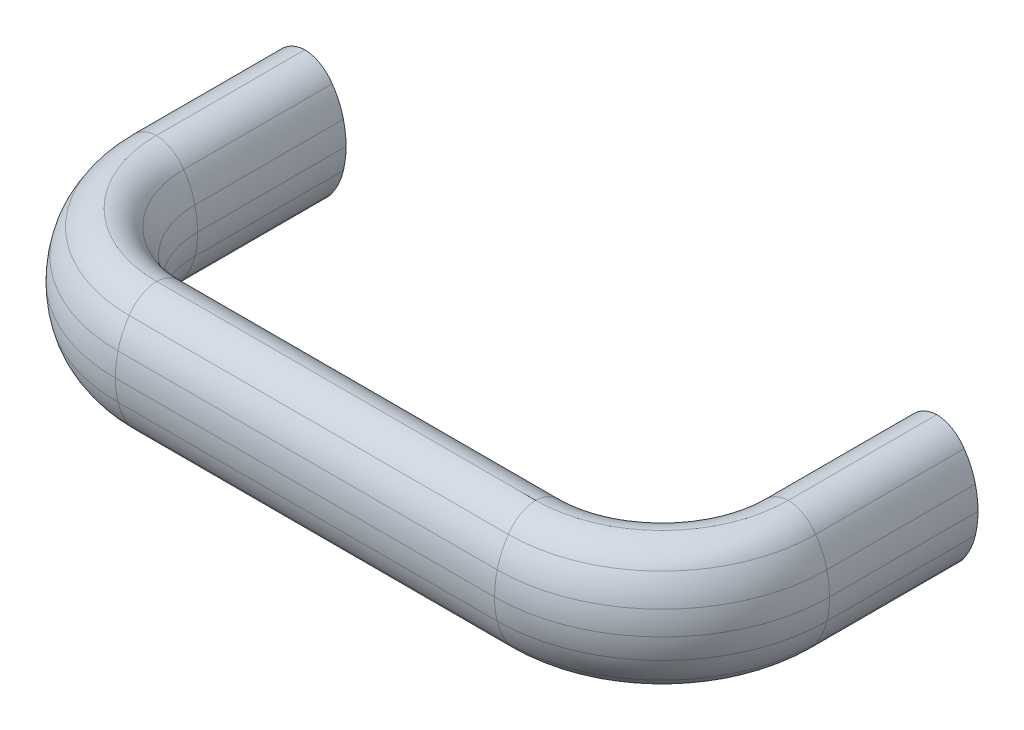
ISO-10303-21;
HEADER;
FILE_DESCRIPTION(('STEP AP214'),'2;1');
FILE_NAME('part.step','',(''),(''),'','','');
FILE_SCHEMA(('AUTOMOTIVE_DESIGN { 1 0 10303 214 1 1 1 1 }'));
ENDSEC;
DATA;
#1=APPLICATION_CONTEXT('core data for automotive mechanical design processes');
#2=APPLICATION_PROTOCOL_DEFINITION('international standard','automotive_design',2000,#1);
#3=PRODUCT_CONTEXT('',#1,'mechanical');
#4=PRODUCT('Part','Part','',(#3));
#5=PRODUCT_RELATED_PRODUCT_CATEGORY('part','',(#4));
#6=PRODUCT_DEFINITION_FORMATION('','',#4);
#7=PRODUCT_DEFINITION_CONTEXT('part definition',#1,'design');
#8=PRODUCT_DEFINITION('design','',#6,#7);
#9=PRODUCT_DEFINITION_SHAPE('','',#8);
#10=(LENGTH_UNIT() NAMED_UNIT(*) SI_UNIT(.MILLI.,.METRE.));
#11=(NAMED_UNIT(*) PLANE_ANGLE_UNIT() SI_UNIT($,.RADIAN.));
#12=(NAMED_UNIT(*) SI_UNIT($,.STERADIAN.) SOLID_ANGLE_UNIT());
#13=UNCERTAINTY_MEASURE_WITH_UNIT(LENGTH_MEASURE(1.E-05),#10,'distance_accuracy_value','');
#14=(GEOMETRIC_REPRESENTATION_CONTEXT(3) GLOBAL_UNCERTAINTY_ASSIGNED_CONTEXT((#13)) GLOBAL_UNIT_ASSIGNED_CONTEXT((#10,
#11,#12)) REPRESENTATION_CONTEXT('',''));
#15=CARTESIAN_POINT('',(0.,0.,0.));
#16=DIRECTION('',(0.,0.,1.));
#17=DIRECTION('',(1.,0.,0.));
#18=AXIS2_PLACEMENT_3D('',#15,#16,#17);
#19=CARTESIAN_POINT('',(91.5962963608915,0.0233169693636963,23.5));
#20=DIRECTION('',(0.,0.,-1.));
#21=DIRECTION('',(0.,-1.,0.));
#22=AXIS2_PLACEMENT_3D('',#19,#20,#21);
#23=CYLINDRICAL_SURFACE('',#22,14.9037218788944);
#24=DIRECTION('',(0.,0.,1.));
#25=VECTOR('',#24,1.);
#26=CARTESIAN_POINT('',(106.085583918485,3.5135135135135,0.));
#27=LINE('',#26,#25);
#28=CARTESIAN_POINT('',(106.085583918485,3.51351351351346,0.));
#29=VERTEX_POINT('',#28);
#30=CARTESIAN_POINT('',(106.085583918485,3.51351351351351,23.5));
#31=VERTEX_POINT('',#30);
#32=EDGE_CURVE('E588',#29,#31,#27,.T.);
#33=ORIENTED_EDGE('',*,*,#32,.T.);
#34=CARTESIAN_POINT('',(91.5962963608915,0.0233169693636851,23.5));
#35=DIRECTION('',(0.,0.,1.));
#36=DIRECTION('',(0.999998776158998,-0.00156450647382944,0.));
#37=AXIS2_PLACEMENT_3D('',#34,#35,#36);
#38=CIRCLE('',#37,14.9037218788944);
#39=CARTESIAN_POINT('',(106.5,0.,23.5));
#40=VERTEX_POINT('',#39);
#41=EDGE_CURVE('E590',#40,#31,#38,.T.);
#42=ORIENTED_EDGE('',*,*,#41,.F.);
#43=DIRECTION('',(0.,0.,1.));
#44=VECTOR('',#43,1.);
#45=CARTESIAN_POINT('',(106.5,0.,0.));
#46=LINE('',#45,#44);
#47=CARTESIAN_POINT('',(106.5,0.,0.));
#48=VERTEX_POINT('',#47);
#49=EDGE_CURVE('E985',#48,#40,#46,.T.);
#50=ORIENTED_EDGE('',*,*,#49,.F.);
#51=CARTESIAN_POINT('',(91.5962963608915,0.0233169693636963,0.));
#52=DIRECTION('',(0.,0.,-1.));
#53=DIRECTION('',(0.972192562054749,0.234182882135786,0.));
#54=AXIS2_PLACEMENT_3D('',#51,#52,#53);
#55=CIRCLE('',#54,14.9037218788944);
#56=EDGE_CURVE('E593',#29,#48,#55,.T.);
#57=ORIENTED_EDGE('',*,*,#56,.F.);
#58=EDGE_LOOP('',(#33,#42,#50,#57));
#59=FACE_BOUND('',#58,.T.);
#60=ADVANCED_FACE('F15',(#59),#23,.T.);
#61=CARTESIAN_POINT('',(80.,0.0233169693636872,23.5));
#62=DIRECTION('',(0.,1.,0.));
#63=DIRECTION('',(1.,0.,0.));
#64=AXIS2_PLACEMENT_3D('',#61,#62,#63);
#65=DEGENERATE_TOROIDAL_SURFACE('',#64,11.5962963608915,14.9037218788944,.T.);
#66=CARTESIAN_POINT('',(80.,3.5135135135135,23.5));
#67=DIRECTION('',(0.,-1.,0.));
#68=DIRECTION('',(1.,0.,0.));
#69=AXIS2_PLACEMENT_3D('',#66,#67,#68);
#70=CIRCLE('',#69,26.0855839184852);
#71=CARTESIAN_POINT('',(80.,3.51351351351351,49.5855839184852));
#72=VERTEX_POINT('',#71);
#73=EDGE_CURVE('E601',#31,#72,#70,.T.);
#74=ORIENTED_EDGE('',*,*,#73,.T.);
#75=CARTESIAN_POINT('',(80.,0.0233169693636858,35.0962963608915));
#76=DIRECTION('',(1.,0.,0.));
#77=DIRECTION('',(0.,0.234182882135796,0.972192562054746));
#78=AXIS2_PLACEMENT_3D('',#75,#76,#77);
#79=CIRCLE('',#78,14.9037218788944);
#80=CARTESIAN_POINT('',(80.,0.,50.));
#81=VERTEX_POINT('',#80);
#82=EDGE_CURVE('E620',#72,#81,#79,.T.);
#83=ORIENTED_EDGE('',*,*,#82,.T.);
#84=CARTESIAN_POINT('',(80.,0.,23.5));
#85=DIRECTION('',(0.,-1.,0.));
#86=DIRECTION('',(1.,0.,0.));
#87=AXIS2_PLACEMENT_3D('',#84,#85,#86);
#88=CIRCLE('',#87,26.5);
#89=EDGE_CURVE('E604',#40,#81,#88,.T.);
#90=ORIENTED_EDGE('',*,*,#89,.F.);
#91=ORIENTED_EDGE('',*,*,#41,.T.);
#92=EDGE_LOOP('',(#74,#83,#90,#91));
#93=FACE_BOUND('',#92,.T.);
#94=ADVANCED_FACE('F578',(#93),#65,.T.);
#95=CARTESIAN_POINT('',(80.,-0.023316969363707,23.5));
#96=DIRECTION('',(0.,1.,0.));
#97=DIRECTION('',(1.,0.,0.));
#98=AXIS2_PLACEMENT_3D('',#95,#96,#97);
#99=DEGENERATE_TOROIDAL_SURFACE('',#98,11.5962963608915,14.9037218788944,.T.);
#100=ORIENTED_EDGE('',*,*,#89,.T.);
#101=CARTESIAN_POINT('',(80.,-0.0233169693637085,35.0962963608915));
#102=DIRECTION('',(1.,0.,0.));
#103=DIRECTION('',(0.,0.00156450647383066,0.999998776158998));
#104=AXIS2_PLACEMENT_3D('',#101,#102,#103);
#105=CIRCLE('',#104,14.9037218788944);
#106=CARTESIAN_POINT('',(80.,-3.51351351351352,49.5855839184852));
#107=VERTEX_POINT('',#106);
#108=EDGE_CURVE('E823',#81,#107,#105,.T.);
#109=ORIENTED_EDGE('',*,*,#108,.T.);
#110=CARTESIAN_POINT('',(80.,-3.51351351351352,23.5));
#111=DIRECTION('',(0.,1.,0.));
#112=DIRECTION('',(0.,0.,1.));
#113=AXIS2_PLACEMENT_3D('',#110,#111,#112);
#114=CIRCLE('',#113,26.0855839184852);
#115=CARTESIAN_POINT('',(106.085583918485,-3.51351351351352,23.5));
#116=VERTEX_POINT('',#115);
#117=EDGE_CURVE('E979',#107,#116,#114,.T.);
#118=ORIENTED_EDGE('',*,*,#117,.T.);
#119=CARTESIAN_POINT('',(91.5962963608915,-0.0233169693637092,23.5));
#120=DIRECTION('',(0.,0.,1.));
#121=DIRECTION('',(0.972192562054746,-0.234182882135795,0.));
#122=AXIS2_PLACEMENT_3D('',#119,#120,#121);
#123=CIRCLE('',#122,14.9037218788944);
#124=EDGE_CURVE('E984',#116,#40,#123,.T.);
#125=ORIENTED_EDGE('',*,*,#124,.T.);
#126=EDGE_LOOP('',(#100,#109,#118,#125));
#127=FACE_BOUND('',#126,.T.);
#128=ADVANCED_FACE('F574',(#127),#99,.T.);
#129=CARTESIAN_POINT('',(91.5962963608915,-0.0233169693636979,23.5));
#130=DIRECTION('',(0.,0.,-1.));
#131=DIRECTION('',(0.,-1.,0.));
#132=AXIS2_PLACEMENT_3D('',#129,#130,#131);
#133=CYLINDRICAL_SURFACE('',#132,14.9037218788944);
#134=ORIENTED_EDGE('',*,*,#49,.T.);
#135=ORIENTED_EDGE('',*,*,#124,.F.);
#136=DIRECTION('',(0.,0.,1.));
#137=VECTOR('',#136,1.);
#138=CARTESIAN_POINT('',(106.085583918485,-3.51351351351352,0.));
#139=LINE('',#138,#137);
#140=CARTESIAN_POINT('',(106.085583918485,-3.51351351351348,0.));
#141=VERTEX_POINT('',#140);
#142=EDGE_CURVE('E981',#141,#116,#139,.T.);
#143=ORIENTED_EDGE('',*,*,#142,.F.);
#144=CARTESIAN_POINT('',(91.5962963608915,-0.0233169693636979,0.));
#145=DIRECTION('',(0.,0.,-1.));
#146=DIRECTION('',(0.999998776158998,0.00156450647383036,0.));
#147=AXIS2_PLACEMENT_3D('',#144,#145,#146);
#148=CIRCLE('',#147,14.9037218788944);
#149=EDGE_CURVE('E862',#48,#141,#148,.T.);
#150=ORIENTED_EDGE('',*,*,#149,.F.);
#151=EDGE_LOOP('',(#134,#135,#143,#150));
#152=FACE_BOUND('',#151,.T.);
#153=ADVANCED_FACE('F570',(#152),#133,.T.);
#154=CARTESIAN_POINT('',(95.0442001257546,-0.961217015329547,23.5));
#155=DIRECTION('',(0.,0.,-1.));
#156=DIRECTION('',(0.,-1.,0.));
#157=AXIS2_PLACEMENT_3D('',#154,#155,#156);
#158=CYLINDRICAL_SURFACE('',#157,11.3325360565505);
#159=ORIENTED_EDGE('',*,*,#142,.T.);
#160=CARTESIAN_POINT('',(95.0442001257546,-0.961217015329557,23.5));
#161=DIRECTION('',(0.,0.,1.));
#162=DIRECTION('',(0.818208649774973,-0.57492139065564,0.));
#163=AXIS2_PLACEMENT_3D('',#160,#161,#162);
#164=CIRCLE('',#163,11.3325360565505);
#165=CARTESIAN_POINT('',(104.316579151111,-7.47653440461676,23.5));
#166=VERTEX_POINT('',#165);
#167=EDGE_CURVE('E976',#166,#116,#164,.T.);
#168=ORIENTED_EDGE('',*,*,#167,.F.);
#169=DIRECTION('',(0.,0.,1.));
#170=VECTOR('',#169,1.);
#171=CARTESIAN_POINT('',(104.316579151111,-7.47653440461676,0.));
#172=LINE('',#171,#170);
#173=CARTESIAN_POINT('',(104.316579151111,-7.47653440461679,0.));
#174=VERTEX_POINT('',#173);
#175=EDGE_CURVE('E895',#174,#166,#172,.T.);
#176=ORIENTED_EDGE('',*,*,#175,.F.);
#177=CARTESIAN_POINT('',(95.0442001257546,-0.961217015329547,0.));
#178=DIRECTION('',(0.,0.,-1.));
#179=DIRECTION('',(0.974308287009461,-0.225218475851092,0.));
#180=AXIS2_PLACEMENT_3D('',#177,#178,#179);
#181=CIRCLE('',#180,11.3325360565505);
#182=EDGE_CURVE('E859',#141,#174,#181,.T.);
#183=ORIENTED_EDGE('',*,*,#182,.F.);
#184=EDGE_LOOP('',(#159,#168,#176,#183));
#185=FACE_BOUND('',#184,.T.);
#186=ADVANCED_FACE('F566',(#185),#158,.T.);
#187=CARTESIAN_POINT('',(80.,-0.961217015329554,23.5));
#188=DIRECTION('',(0.,1.,0.));
#189=DIRECTION('',(1.,0.,0.));
#190=AXIS2_PLACEMENT_3D('',#187,#188,#189);
#191=TOROIDAL_SURFACE('',#190,15.0442001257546,11.3325360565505);
#192=ORIENTED_EDGE('',*,*,#117,.F.);
#193=CARTESIAN_POINT('',(80.,-0.961217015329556,38.5442001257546));
#194=DIRECTION('',(1.,0.,0.));
#195=DIRECTION('',(0.,-0.225218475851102,0.974308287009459));
#196=AXIS2_PLACEMENT_3D('',#193,#194,#195);
#197=CIRCLE('',#196,11.3325360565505);
#198=CARTESIAN_POINT('',(80.,-7.47653440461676,47.816579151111));
#199=VERTEX_POINT('',#198);
#200=EDGE_CURVE('E826',#107,#199,#197,.T.);
#201=ORIENTED_EDGE('',*,*,#200,.T.);
#202=CARTESIAN_POINT('',(80.,-7.47653440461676,23.5));
#203=DIRECTION('',(0.,-1.,0.));
#204=DIRECTION('',(1.,0.,0.));
#205=AXIS2_PLACEMENT_3D('',#202,#203,#204);
#206=CIRCLE('',#205,24.316579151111);
#207=EDGE_CURVE('E970',#166,#199,#206,.T.);
#208=ORIENTED_EDGE('',*,*,#207,.F.);
#209=ORIENTED_EDGE('',*,*,#167,.T.);
#210=EDGE_LOOP('',(#192,#201,#208,#209));
#211=FACE_BOUND('',#210,.T.);
#212=ADVANCED_FACE('F562',(#211),#191,.T.);
#213=CARTESIAN_POINT('',(80.,-4.49051001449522,23.5));
#214=DIRECTION('',(0.,1.,0.));
#215=DIRECTION('',(1.,0.,0.));
#216=AXIS2_PLACEMENT_3D('',#213,#214,#215);
#217=TOROIDAL_SURFACE('',#216,19.6750571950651,5.51906402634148);
#218=ORIENTED_EDGE('',*,*,#207,.T.);
#219=CARTESIAN_POINT('',(80.,-4.49051001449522,43.1750571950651));
#220=DIRECTION('',(1.,0.,0.));
#221=DIRECTION('',(0.,-0.541038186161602,0.840998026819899));
#222=AXIS2_PLACEMENT_3D('',#219,#220,#221);
#223=CIRCLE('',#222,5.51906402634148);
#224=CARTESIAN_POINT('',(80.,-10.,43.5));
#225=VERTEX_POINT('',#224);
#226=EDGE_CURVE('E829',#199,#225,#223,.T.);
#227=ORIENTED_EDGE('',*,*,#226,.T.);
#228=CARTESIAN_POINT('',(80.,-10.,23.5));
#229=DIRECTION('',(0.,-1.,0.));
#230=DIRECTION('',(1.,0.,0.));
#231=AXIS2_PLACEMENT_3D('',#228,#229,#230);
#232=CIRCLE('',#231,20.);
#233=CARTESIAN_POINT('',(100.,-10.,23.5));
#234=VERTEX_POINT('',#233);
#235=EDGE_CURVE('E964',#234,#225,#232,.T.);
#236=ORIENTED_EDGE('',*,*,#235,.F.);
#237=CARTESIAN_POINT('',(99.6750571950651,-4.49051001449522,23.5));
#238=DIRECTION('',(0.,0.,1.));
#239=DIRECTION('',(0.0588764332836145,-0.99826527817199,0.));
#240=AXIS2_PLACEMENT_3D('',#237,#238,#239);
#241=CIRCLE('',#240,5.51906402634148);
#242=EDGE_CURVE('E894',#234,#166,#241,.T.);
#243=ORIENTED_EDGE('',*,*,#242,.T.);
#244=EDGE_LOOP('',(#218,#227,#236,#243));
#245=FACE_BOUND('',#244,.T.);
#246=ADVANCED_FACE('F558',(#245),#217,.T.);
#247=CARTESIAN_POINT('',(80.,-4.49051001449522,23.5));
#248=DIRECTION('',(0.,1.,0.));
#249=DIRECTION('',(1.,0.,0.));
#250=AXIS2_PLACEMENT_3D('',#247,#248,#249);
#251=TOROIDAL_SURFACE('',#250,20.3249428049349,5.51906402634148);
#252=ORIENTED_EDGE('',*,*,#235,.T.);
#253=CARTESIAN_POINT('',(80.,-4.49051001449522,43.8249428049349));
#254=DIRECTION('',(1.,0.,0.));
#255=DIRECTION('',(0.,-0.99826527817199,-0.0588764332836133));
#256=AXIS2_PLACEMENT_3D('',#253,#254,#255);
#257=CIRCLE('',#256,5.51906402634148);
#258=CARTESIAN_POINT('',(80.,-7.47653440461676,39.183420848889));
#259=VERTEX_POINT('',#258);
#260=EDGE_CURVE('E832',#225,#259,#257,.T.);
#261=ORIENTED_EDGE('',*,*,#260,.T.);
#262=CARTESIAN_POINT('',(80.,-7.47653440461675,23.5));
#263=DIRECTION('',(0.,-1.,0.));
#264=DIRECTION('',(1.,0.,0.));
#265=AXIS2_PLACEMENT_3D('',#262,#263,#264);
#266=CIRCLE('',#265,15.683420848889);
#267=CARTESIAN_POINT('',(95.683420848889,-7.47653440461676,23.5));
#268=VERTEX_POINT('',#267);
#269=EDGE_CURVE('E956',#268,#259,#266,.T.);
#270=ORIENTED_EDGE('',*,*,#269,.F.);
#271=CARTESIAN_POINT('',(100.324942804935,-4.49051001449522,23.5));
#272=DIRECTION('',(0.,0.,1.));
#273=DIRECTION('',(-0.840998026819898,-0.541038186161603,0.));
#274=AXIS2_PLACEMENT_3D('',#271,#272,#273);
#275=CIRCLE('',#274,5.51906402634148);
#276=EDGE_CURVE('E901',#268,#234,#275,.T.);
#277=ORIENTED_EDGE('',*,*,#276,.T.);
#278=EDGE_LOOP('',(#252,#261,#270,#277));
#279=FACE_BOUND('',#278,.T.);
#280=ADVANCED_FACE('F554',(#279),#251,.T.);
#281=CARTESIAN_POINT('',(80.,-0.961217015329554,23.5));
#282=DIRECTION('',(0.,1.,0.));
#283=DIRECTION('',(1.,0.,0.));
#284=AXIS2_PLACEMENT_3D('',#281,#282,#283);
#285=TOROIDAL_SURFACE('',#284,24.9557998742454,11.3325360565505);
#286=ORIENTED_EDGE('',*,*,#269,.T.);
#287=CARTESIAN_POINT('',(80.,-0.961217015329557,48.4557998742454));
#288=DIRECTION('',(1.,0.,0.));
#289=DIRECTION('',(0.,-0.57492139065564,-0.818208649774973));
#290=AXIS2_PLACEMENT_3D('',#287,#288,#289);
#291=CIRCLE('',#290,11.3325360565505);
#292=CARTESIAN_POINT('',(80.,-3.51351351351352,37.4144160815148));
#293=VERTEX_POINT('',#292);
#294=EDGE_CURVE('E835',#259,#293,#291,.T.);
#295=ORIENTED_EDGE('',*,*,#294,.T.);
#296=CARTESIAN_POINT('',(80.,-3.51351351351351,23.5));
#297=DIRECTION('',(0.,-1.,0.));
#298=DIRECTION('',(1.,0.,0.));
#299=AXIS2_PLACEMENT_3D('',#296,#297,#298);
#300=CIRCLE('',#299,13.9144160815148);
#301=CARTESIAN_POINT('',(93.9144160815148,-3.51351351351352,23.5));
#302=VERTEX_POINT('',#301);
#303=EDGE_CURVE('E948',#302,#293,#300,.T.);
#304=ORIENTED_EDGE('',*,*,#303,.F.);
#305=CARTESIAN_POINT('',(104.955799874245,-0.961217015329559,23.5));
#306=DIRECTION('',(0.,0.,1.));
#307=DIRECTION('',(-0.974308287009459,-0.225218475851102,0.));
#308=AXIS2_PLACEMENT_3D('',#305,#306,#307);
#309=CIRCLE('',#308,11.3325360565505);
#310=EDGE_CURVE('E905',#302,#268,#309,.T.);
#311=ORIENTED_EDGE('',*,*,#310,.T.);
#312=EDGE_LOOP('',(#286,#295,#304,#311));
#313=FACE_BOUND('',#312,.T.);
#314=ADVANCED_FACE('F550',(#313),#285,.T.);
#315=CARTESIAN_POINT('',(80.,-0.023316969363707,23.5));
#316=DIRECTION('',(0.,1.,0.));
#317=DIRECTION('',(1.,0.,0.));
#318=AXIS2_PLACEMENT_3D('',#315,#316,#317);
#319=TOROIDAL_SURFACE('',#318,28.4037036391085,14.9037218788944);
#320=CARTESIAN_POINT('',(108.403703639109,-0.0233169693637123,23.5));
#321=DIRECTION('',(0.,0.,1.));
#322=DIRECTION('',(-1.,0.,0.));
#323=AXIS2_PLACEMENT_3D('',#320,#321,#322);
#324=CIRCLE('',#323,14.9037218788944);
#325=CARTESIAN_POINT('',(93.4999817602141,-0.02331696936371,23.5));
#326=VERTEX_POINT('',#325);
#327=EDGE_CURVE('E914',#326,#302,#324,.T.);
#328=ORIENTED_EDGE('',*,*,#327,.T.);
#329=ORIENTED_EDGE('',*,*,#303,.T.);
#330=CARTESIAN_POINT('',(80.,-0.0233169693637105,51.9037036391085));
#331=DIRECTION('',(1.,0.,0.));
#332=DIRECTION('',(0.,-0.234182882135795,-0.972192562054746));
#333=AXIS2_PLACEMENT_3D('',#330,#331,#332);
#334=CIRCLE('',#333,14.9037218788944);
#335=CARTESIAN_POINT('',(80.,-0.0233169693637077,36.9999817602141));
#336=VERTEX_POINT('',#335);
#337=EDGE_CURVE('E838',#293,#336,#334,.T.);
#338=ORIENTED_EDGE('',*,*,#337,.T.);
#339=DIRECTION('',(0.,0.999999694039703,0.000782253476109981));
#340=VECTOR('',#339,1.);
#341=CARTESIAN_POINT('',(80.,-0.0233169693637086,36.9999817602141));
#342=LINE('',#341,#340);
#343=CARTESIAN_POINT('',(80.,0.,37.));
#344=VERTEX_POINT('',#343);
#345=EDGE_CURVE('E842',#336,#344,#342,.T.);
#346=ORIENTED_EDGE('',*,*,#345,.T.);
#347=CARTESIAN_POINT('',(80.,0.,23.5));
#348=DIRECTION('',(0.,-1.,0.));
#349=DIRECTION('',(1.,0.,0.));
#350=AXIS2_PLACEMENT_3D('',#347,#348,#349);
#351=CIRCLE('',#350,13.5);
#352=CARTESIAN_POINT('',(93.5,0.,23.5));
#353=VERTEX_POINT('',#352);
#354=EDGE_CURVE('E942',#353,#344,#351,.T.);
#355=ORIENTED_EDGE('',*,*,#354,.F.);
#356=DIRECTION('',(-0.000782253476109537,-0.999999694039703,0.));
#357=VECTOR('',#356,1.);
#358=CARTESIAN_POINT('',(93.5,0.,23.5));
#359=LINE('',#358,#357);
#360=EDGE_CURVE('E909',#353,#326,#359,.T.);
#361=ORIENTED_EDGE('',*,*,#360,.T.);
#362=EDGE_LOOP('',(#328,#329,#338,#346,#355,#361));
#363=FACE_BOUND('',#362,.T.);
#364=ADVANCED_FACE('F546',(#363),#319,.T.);
#365=CARTESIAN_POINT('',(80.,0.0233169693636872,23.5));
#366=DIRECTION('',(0.,1.,0.));
#367=DIRECTION('',(1.,0.,0.));
#368=AXIS2_PLACEMENT_3D('',#365,#366,#367);
#369=TOROIDAL_SURFACE('',#368,28.4037036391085,14.9037218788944);
#370=DIRECTION('',(0.000782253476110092,-0.999999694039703,0.));
#371=VECTOR('',#370,1.);
#372=CARTESIAN_POINT('',(93.4999817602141,0.0233169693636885,23.5));
#373=LINE('',#372,#371);
#374=CARTESIAN_POINT('',(93.4999817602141,0.0233169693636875,23.5));
#375=VERTEX_POINT('',#374);
#376=EDGE_CURVE('E919',#375,#353,#373,.T.);
#377=ORIENTED_EDGE('',*,*,#376,.T.);
#378=ORIENTED_EDGE('',*,*,#354,.T.);
#379=DIRECTION('',(0.,0.999999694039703,-0.000782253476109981));
#380=VECTOR('',#379,1.);
#381=CARTESIAN_POINT('',(80.,0.,37.));
#382=LINE('',#381,#380);
#383=CARTESIAN_POINT('',(80.,0.0233169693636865,36.9999817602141));
#384=VERTEX_POINT('',#383);
#385=EDGE_CURVE('E841',#344,#384,#382,.T.);
#386=ORIENTED_EDGE('',*,*,#385,.T.);
#387=CARTESIAN_POINT('',(80.,0.0233169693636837,51.9037036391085));
#388=DIRECTION('',(1.,0.,0.));
#389=DIRECTION('',(0.,0.,-1.));
#390=AXIS2_PLACEMENT_3D('',#387,#388,#389);
#391=CIRCLE('',#390,14.9037218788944);
#392=CARTESIAN_POINT('',(80.,3.5135135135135,37.4144160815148));
#393=VERTEX_POINT('',#392);
#394=EDGE_CURVE('E850',#384,#393,#391,.T.);
#395=ORIENTED_EDGE('',*,*,#394,.T.);
#396=CARTESIAN_POINT('',(80.,3.5135135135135,23.5));
#397=DIRECTION('',(0.,-1.,0.));
#398=DIRECTION('',(1.,0.,0.));
#399=AXIS2_PLACEMENT_3D('',#396,#397,#398);
#400=CIRCLE('',#399,13.9144160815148);
#401=CARTESIAN_POINT('',(93.9144160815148,3.51351351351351,23.5));
#402=VERTEX_POINT('',#401);
#403=EDGE_CURVE('E938',#402,#393,#400,.T.);
#404=ORIENTED_EDGE('',*,*,#403,.F.);
#405=CARTESIAN_POINT('',(108.403703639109,0.023316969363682,23.5));
#406=DIRECTION('',(0.,0.,1.));
#407=DIRECTION('',(-0.972192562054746,0.234182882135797,0.));
#408=AXIS2_PLACEMENT_3D('',#405,#406,#407);
#409=CIRCLE('',#408,14.9037218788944);
#410=EDGE_CURVE('E913',#402,#375,#409,.T.);
#411=ORIENTED_EDGE('',*,*,#410,.T.);
#412=EDGE_LOOP('',(#377,#378,#386,#395,#404,#411));
#413=FACE_BOUND('',#412,.T.);
#414=ADVANCED_FACE('F542',(#413),#369,.T.);
#415=CARTESIAN_POINT('',(80.,0.961217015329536,23.5));
#416=DIRECTION('',(0.,1.,0.));
#417=DIRECTION('',(1.,0.,0.));
#418=AXIS2_PLACEMENT_3D('',#415,#416,#417);
#419=TOROIDAL_SURFACE('',#418,24.9557998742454,11.3325360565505);
#420=ORIENTED_EDGE('',*,*,#403,.T.);
#421=CARTESIAN_POINT('',(80.,0.961217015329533,48.4557998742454));
#422=DIRECTION('',(1.,0.,0.));
#423=DIRECTION('',(0.,0.225218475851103,-0.974308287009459));
#424=AXIS2_PLACEMENT_3D('',#421,#422,#423);
#425=CIRCLE('',#424,11.3325360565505);
#426=CARTESIAN_POINT('',(80.,7.47653440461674,39.183420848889));
#427=VERTEX_POINT('',#426);
#428=EDGE_CURVE('E847',#393,#427,#425,.T.);
#429=ORIENTED_EDGE('',*,*,#428,.T.);
#430=CARTESIAN_POINT('',(80.,7.47653440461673,23.5));
#431=DIRECTION('',(0.,1.,0.));
#432=DIRECTION('',(0.,0.,1.));
#433=AXIS2_PLACEMENT_3D('',#430,#431,#432);
#434=CIRCLE('',#433,15.683420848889);
#435=CARTESIAN_POINT('',(95.683420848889,7.47653440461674,23.5));
#436=VERTEX_POINT('',#435);
#437=EDGE_CURVE('E931',#427,#436,#434,.T.);
#438=ORIENTED_EDGE('',*,*,#437,.T.);
#439=CARTESIAN_POINT('',(104.955799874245,0.961217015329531,23.5));
#440=DIRECTION('',(0.,0.,1.));
#441=DIRECTION('',(-0.818208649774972,0.574921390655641,0.));
#442=AXIS2_PLACEMENT_3D('',#439,#440,#441);
#443=CIRCLE('',#442,11.3325360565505);
#444=EDGE_CURVE('E918',#436,#402,#443,.T.);
#445=ORIENTED_EDGE('',*,*,#444,.T.);
#446=EDGE_LOOP('',(#420,#429,#438,#445));
#447=FACE_BOUND('',#446,.T.);
#448=ADVANCED_FACE('F538',(#447),#419,.T.);
#449=CARTESIAN_POINT('',(80.,4.4905100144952,23.5));
#450=DIRECTION('',(0.,1.,0.));
#451=DIRECTION('',(1.,0.,0.));
#452=AXIS2_PLACEMENT_3D('',#449,#450,#451);
#453=TOROIDAL_SURFACE('',#452,20.3249428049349,5.51906402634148);
#454=ORIENTED_EDGE('',*,*,#437,.F.);
#455=CARTESIAN_POINT('',(80.,4.4905100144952,43.8249428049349));
#456=DIRECTION('',(1.,0.,0.));
#457=DIRECTION('',(0.,0.541038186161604,-0.840998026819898));
#458=AXIS2_PLACEMENT_3D('',#455,#456,#457);
#459=CIRCLE('',#458,5.51906402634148);
#460=CARTESIAN_POINT('',(80.,10.,43.5));
#461=VERTEX_POINT('',#460);
#462=EDGE_CURVE('E846',#427,#461,#459,.T.);
#463=ORIENTED_EDGE('',*,*,#462,.T.);
#464=CARTESIAN_POINT('',(80.,10.,23.5));
#465=DIRECTION('',(0.,-1.,0.));
#466=DIRECTION('',(1.,0.,0.));
#467=AXIS2_PLACEMENT_3D('',#464,#465,#466);
#468=CIRCLE('',#467,20.);
#469=CARTESIAN_POINT('',(100.,10.,23.5));
#470=VERTEX_POINT('',#469);
#471=EDGE_CURVE('E927',#470,#461,#468,.T.);
#472=ORIENTED_EDGE('',*,*,#471,.F.);
#473=CARTESIAN_POINT('',(100.324942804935,4.4905100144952,23.5));
#474=DIRECTION('',(0.,0.,1.));
#475=DIRECTION('',(-0.0588764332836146,0.99826527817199,0.));
#476=AXIS2_PLACEMENT_3D('',#473,#474,#475);
#477=CIRCLE('',#476,5.51906402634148);
#478=EDGE_CURVE('E923',#470,#436,#477,.T.);
#479=ORIENTED_EDGE('',*,*,#478,.T.);
#480=EDGE_LOOP('',(#454,#463,#472,#479));
#481=FACE_BOUND('',#480,.T.);
#482=ADVANCED_FACE('F534',(#481),#453,.T.);
#483=CARTESIAN_POINT('',(80.,4.4905100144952,23.5));
#484=DIRECTION('',(0.,1.,0.));
#485=DIRECTION('',(1.,0.,0.));
#486=AXIS2_PLACEMENT_3D('',#483,#484,#485);
#487=TOROIDAL_SURFACE('',#486,19.6750571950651,5.51906402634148);
#488=ORIENTED_EDGE('',*,*,#471,.T.);
#489=CARTESIAN_POINT('',(80.,4.4905100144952,43.1750571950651));
#490=DIRECTION('',(1.,0.,0.));
#491=DIRECTION('',(0.,0.99826527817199,0.0588764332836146));
#492=AXIS2_PLACEMENT_3D('',#489,#490,#491);
#493=CIRCLE('',#492,5.51906402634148);
#494=CARTESIAN_POINT('',(80.,7.47653440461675,47.816579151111));
#495=VERTEX_POINT('',#494);
#496=EDGE_CURVE('E852',#461,#495,#493,.T.);
#497=ORIENTED_EDGE('',*,*,#496,.T.);
#498=CARTESIAN_POINT('',(80.,7.47653440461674,23.5));
#499=DIRECTION('',(0.,-1.,0.));
#500=DIRECTION('',(1.,0.,0.));
#501=AXIS2_PLACEMENT_3D('',#498,#499,#500);
#502=CIRCLE('',#501,24.316579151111);
#503=CARTESIAN_POINT('',(104.316579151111,7.47653440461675,23.5));
#504=VERTEX_POINT('',#503);
#505=EDGE_CURVE('E616',#504,#495,#502,.T.);
#506=ORIENTED_EDGE('',*,*,#505,.F.);
#507=CARTESIAN_POINT('',(99.6750571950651,4.4905100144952,23.5));
#508=DIRECTION('',(0.,0.,1.));
#509=DIRECTION('',(0.840998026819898,0.541038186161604,0.));
#510=AXIS2_PLACEMENT_3D('',#507,#508,#509);
#511=CIRCLE('',#510,5.51906402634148);
#512=EDGE_CURVE('E924',#504,#470,#511,.T.);
#513=ORIENTED_EDGE('',*,*,#512,.T.);
#514=EDGE_LOOP('',(#488,#497,#506,#513));
#515=FACE_BOUND('',#514,.T.);
#516=ADVANCED_FACE('F530',(#515),#487,.T.);
#517=CARTESIAN_POINT('',(99.6750571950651,4.4905100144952,23.5));
#518=DIRECTION('',(0.,0.,-1.));
#519=DIRECTION('',(0.,-1.,0.));
#520=AXIS2_PLACEMENT_3D('',#517,#518,#519);
#521=CYLINDRICAL_SURFACE('',#520,5.51906402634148);
#522=DIRECTION('',(0.,0.,1.));
#523=VECTOR('',#522,1.);
#524=CARTESIAN_POINT('',(100.,10.,0.));
#525=LINE('',#524,#523);
#526=CARTESIAN_POINT('',(100.,10.,0.));
#527=VERTEX_POINT('',#526);
#528=EDGE_CURVE('E920',#527,#470,#525,.T.);
#529=ORIENTED_EDGE('',*,*,#528,.T.);
#530=ORIENTED_EDGE('',*,*,#512,.F.);
#531=DIRECTION('',(0.,0.,1.));
#532=VECTOR('',#531,1.);
#533=CARTESIAN_POINT('',(104.316579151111,7.47653440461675,0.));
#534=LINE('',#533,#532);
#535=CARTESIAN_POINT('',(104.316579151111,7.47653440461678,0.));
#536=VERTEX_POINT('',#535);
#537=EDGE_CURVE('E597',#536,#504,#534,.T.);
#538=ORIENTED_EDGE('',*,*,#537,.F.);
#539=CARTESIAN_POINT('',(99.6750571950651,4.4905100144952,0.));
#540=DIRECTION('',(0.,0.,-1.));
#541=DIRECTION('',(0.0588764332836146,0.99826527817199,0.));
#542=AXIS2_PLACEMENT_3D('',#539,#540,#541);
#543=CIRCLE('',#542,5.51906402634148);
#544=EDGE_CURVE('E866',#527,#536,#543,.T.);
#545=ORIENTED_EDGE('',*,*,#544,.F.);
#546=EDGE_LOOP('',(#529,#530,#538,#545));
#547=FACE_BOUND('',#546,.T.);
#548=ADVANCED_FACE('F526',(#547),#521,.T.);
#549=CARTESIAN_POINT('',(100.324942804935,4.4905100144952,23.5));
#550=DIRECTION('',(0.,0.,-1.));
#551=DIRECTION('',(0.,-1.,0.));
#552=AXIS2_PLACEMENT_3D('',#549,#550,#551);
#553=CYLINDRICAL_SURFACE('',#552,5.51906402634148);
#554=DIRECTION('',(0.,0.,1.));
#555=VECTOR('',#554,1.);
#556=CARTESIAN_POINT('',(95.683420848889,7.47653440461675,0.));
#557=LINE('',#556,#555);
#558=CARTESIAN_POINT('',(95.683420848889,7.47653440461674,0.));
#559=VERTEX_POINT('',#558);
#560=EDGE_CURVE('E915',#559,#436,#557,.T.);
#561=ORIENTED_EDGE('',*,*,#560,.T.);
#562=ORIENTED_EDGE('',*,*,#478,.F.);
#563=ORIENTED_EDGE('',*,*,#528,.F.);
#564=CARTESIAN_POINT('',(100.324942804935,4.4905100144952,0.));
#565=DIRECTION('',(0.,0.,-1.));
#566=DIRECTION('',(-0.8409980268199,0.5410381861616,0.));
#567=AXIS2_PLACEMENT_3D('',#564,#565,#566);
#568=CIRCLE('',#567,5.51906402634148);
#569=EDGE_CURVE('E870',#559,#527,#568,.T.);
#570=ORIENTED_EDGE('',*,*,#569,.F.);
#571=EDGE_LOOP('',(#561,#562,#563,#570));
#572=FACE_BOUND('',#571,.T.);
#573=ADVANCED_FACE('F522',(#572),#553,.T.);
#574=CARTESIAN_POINT('',(104.955799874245,0.961217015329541,23.5));
#575=DIRECTION('',(0.,0.,-1.));
#576=DIRECTION('',(0.,-1.,0.));
#577=AXIS2_PLACEMENT_3D('',#574,#575,#576);
#578=CYLINDRICAL_SURFACE('',#577,11.3325360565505);
#579=DIRECTION('',(0.,0.,1.));
#580=VECTOR('',#579,1.);
#581=CARTESIAN_POINT('',(93.9144160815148,3.51351351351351,0.));
#582=LINE('',#581,#580);
#583=CARTESIAN_POINT('',(93.9144160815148,3.5135135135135,0.));
#584=VERTEX_POINT('',#583);
#585=EDGE_CURVE('E910',#584,#402,#582,.T.);
#586=ORIENTED_EDGE('',*,*,#585,.T.);
#587=ORIENTED_EDGE('',*,*,#444,.F.);
#588=ORIENTED_EDGE('',*,*,#560,.F.);
#589=CARTESIAN_POINT('',(104.955799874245,0.961217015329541,0.));
#590=DIRECTION('',(0.,0.,-1.));
#591=DIRECTION('',(-0.97430828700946,0.225218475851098,0.));
#592=AXIS2_PLACEMENT_3D('',#589,#590,#591);
#593=CIRCLE('',#592,11.3325360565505);
#594=EDGE_CURVE('E873',#584,#559,#593,.T.);
#595=ORIENTED_EDGE('',*,*,#594,.F.);
#596=EDGE_LOOP('',(#586,#587,#588,#595));
#597=FACE_BOUND('',#596,.T.);
#598=ADVANCED_FACE('F518',(#597),#578,.T.);
#599=CARTESIAN_POINT('',(108.403703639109,0.0233169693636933,23.5));
#600=DIRECTION('',(0.,0.,-1.));
#601=DIRECTION('',(0.,-1.,0.));
#602=AXIS2_PLACEMENT_3D('',#599,#600,#601);
#603=CYLINDRICAL_SURFACE('',#602,14.9037218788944);
#604=DIRECTION('',(0.,0.,1.));
#605=VECTOR('',#604,1.);
#606=CARTESIAN_POINT('',(93.5,0.,0.));
#607=LINE('',#606,#605);
#608=CARTESIAN_POINT('',(93.5,0.,0.));
#609=VERTEX_POINT('',#608);
#610=EDGE_CURVE('E906',#609,#353,#607,.T.);
#611=ORIENTED_EDGE('',*,*,#610,.T.);
#612=ORIENTED_EDGE('',*,*,#376,.F.);
#613=ORIENTED_EDGE('',*,*,#410,.F.);
#614=ORIENTED_EDGE('',*,*,#585,.F.);
#615=CARTESIAN_POINT('',(108.403703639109,0.0233169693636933,0.));
#616=DIRECTION('',(0.,0.,-1.));
#617=DIRECTION('',(-0.999998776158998,-0.00156450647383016,0.));
#618=AXIS2_PLACEMENT_3D('',#615,#616,#617);
#619=CIRCLE('',#618,14.9037218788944);
#620=EDGE_CURVE('E876',#609,#584,#619,.T.);
#621=ORIENTED_EDGE('',*,*,#620,.F.);
#622=EDGE_LOOP('',(#611,#612,#613,#614,#621));
#623=FACE_BOUND('',#622,.T.);
#624=ADVANCED_FACE('F514',(#623),#603,.T.);
#625=CARTESIAN_POINT('',(108.403703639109,-0.023316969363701,23.5));
#626=DIRECTION('',(0.,0.,-1.));
#627=DIRECTION('',(0.,-1.,0.));
#628=AXIS2_PLACEMENT_3D('',#625,#626,#627);
#629=CYLINDRICAL_SURFACE('',#628,14.9037218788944);
#630=DIRECTION('',(0.,0.,1.));
#631=VECTOR('',#630,1.);
#632=CARTESIAN_POINT('',(93.9144160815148,-3.51351351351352,0.));
#633=LINE('',#632,#631);
#634=CARTESIAN_POINT('',(93.9144160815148,-3.51351351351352,0.));
#635=VERTEX_POINT('',#634);
#636=EDGE_CURVE('E902',#635,#302,#633,.T.);
#637=ORIENTED_EDGE('',*,*,#636,.T.);
#638=ORIENTED_EDGE('',*,*,#327,.F.);
#639=ORIENTED_EDGE('',*,*,#360,.F.);
#640=ORIENTED_EDGE('',*,*,#610,.F.);
#641=CARTESIAN_POINT('',(108.403703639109,-0.023316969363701,0.));
#642=DIRECTION('',(0.,0.,-1.));
#643=DIRECTION('',(-0.972192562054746,-0.234182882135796,0.));
#644=AXIS2_PLACEMENT_3D('',#641,#642,#643);
#645=CIRCLE('',#644,14.9037218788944);
#646=EDGE_CURVE('E879',#635,#609,#645,.T.);
#647=ORIENTED_EDGE('',*,*,#646,.F.);
#648=EDGE_LOOP('',(#637,#638,#639,#640,#647));
#649=FACE_BOUND('',#648,.T.);
#650=ADVANCED_FACE('F510',(#649),#629,.T.);
#651=CARTESIAN_POINT('',(104.955799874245,-0.961217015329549,23.5));
#652=DIRECTION('',(0.,0.,-1.));
#653=DIRECTION('',(0.,-1.,0.));
#654=AXIS2_PLACEMENT_3D('',#651,#652,#653);
#655=CYLINDRICAL_SURFACE('',#654,11.3325360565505);
#656=DIRECTION('',(0.,0.,1.));
#657=VECTOR('',#656,1.);
#658=CARTESIAN_POINT('',(95.683420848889,-7.47653440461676,0.));
#659=LINE('',#658,#657);
#660=CARTESIAN_POINT('',(95.683420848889,-7.47653440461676,0.));
#661=VERTEX_POINT('',#660);
#662=EDGE_CURVE('E898',#661,#268,#659,.T.);
#663=ORIENTED_EDGE('',*,*,#662,.T.);
#664=ORIENTED_EDGE('',*,*,#310,.F.);
#665=ORIENTED_EDGE('',*,*,#636,.F.);
#666=CARTESIAN_POINT('',(104.955799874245,-0.961217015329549,0.));
#667=DIRECTION('',(0.,0.,-1.));
#668=DIRECTION('',(-0.818208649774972,-0.574921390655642,0.));
#669=AXIS2_PLACEMENT_3D('',#666,#667,#668);
#670=CIRCLE('',#669,11.3325360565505);
#671=EDGE_CURVE('E882',#661,#635,#670,.T.);
#672=ORIENTED_EDGE('',*,*,#671,.F.);
#673=EDGE_LOOP('',(#663,#664,#665,#672));
#674=FACE_BOUND('',#673,.T.);
#675=ADVANCED_FACE('F506',(#674),#655,.T.);
#676=CARTESIAN_POINT('',(100.324942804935,-4.49051001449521,23.5));
#677=DIRECTION('',(0.,0.,-1.));
#678=DIRECTION('',(0.,-1.,0.));
#679=AXIS2_PLACEMENT_3D('',#676,#677,#678);
#680=CYLINDRICAL_SURFACE('',#679,5.51906402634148);
#681=DIRECTION('',(0.,0.,-1.));
#682=VECTOR('',#681,1.);
#683=CARTESIAN_POINT('',(100.,-10.,23.5));
#684=LINE('',#683,#682);
#685=CARTESIAN_POINT('',(100.,-10.,0.));
#686=VERTEX_POINT('',#685);
#687=EDGE_CURVE('E891',#234,#686,#684,.T.);
#688=ORIENTED_EDGE('',*,*,#687,.F.);
#689=ORIENTED_EDGE('',*,*,#276,.F.);
#690=ORIENTED_EDGE('',*,*,#662,.F.);
#691=CARTESIAN_POINT('',(100.324942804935,-4.49051001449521,0.));
#692=DIRECTION('',(0.,0.,-1.));
#693=DIRECTION('',(-0.0588764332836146,-0.99826527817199,0.));
#694=AXIS2_PLACEMENT_3D('',#691,#692,#693);
#695=CIRCLE('',#694,5.51906402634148);
#696=EDGE_CURVE('E885',#686,#661,#695,.T.);
#697=ORIENTED_EDGE('',*,*,#696,.F.);
#698=EDGE_LOOP('',(#688,#689,#690,#697));
#699=FACE_BOUND('',#698,.T.);
#700=ADVANCED_FACE('F502',(#699),#680,.T.);
#701=CARTESIAN_POINT('',(99.6750571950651,-4.49051001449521,23.5));
#702=DIRECTION('',(0.,0.,-1.));
#703=DIRECTION('',(0.,-1.,0.));
#704=AXIS2_PLACEMENT_3D('',#701,#702,#703);
#705=CYLINDRICAL_SURFACE('',#704,5.51906402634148);
#706=ORIENTED_EDGE('',*,*,#175,.T.);
#707=ORIENTED_EDGE('',*,*,#242,.F.);
#708=ORIENTED_EDGE('',*,*,#687,.T.);
#709=CARTESIAN_POINT('',(99.6750571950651,-4.49051001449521,0.));
#710=DIRECTION('',(0.,0.,-1.));
#711=DIRECTION('',(0.840998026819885,-0.541038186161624,0.));
#712=AXIS2_PLACEMENT_3D('',#709,#710,#711);
#713=CIRCLE('',#712,5.51906402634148);
#714=EDGE_CURVE('E856',#174,#686,#713,.T.);
#715=ORIENTED_EDGE('',*,*,#714,.F.);
#716=EDGE_LOOP('',(#706,#707,#708,#715));
#717=FACE_BOUND('',#716,.T.);
#718=ADVANCED_FACE('F498',(#717),#705,.T.);
#719=CARTESIAN_POINT('',(100.,0.,0.));
#720=DIRECTION('',(0.,0.,-1.));
#721=DIRECTION('',(0.,-1.,0.));
#722=AXIS2_PLACEMENT_3D('',#719,#720,#721);
#723=PLANE('',#722);
#724=CARTESIAN_POINT('',(100.,0.,0.));
#725=DIRECTION('',(0.,0.,1.));
#726=DIRECTION('',(1.,0.,0.));
#727=AXIS2_PLACEMENT_3D('',#724,#725,#726);
#728=CIRCLE('',#727,3.);
#729=CARTESIAN_POINT('',(103.,0.,0.));
#730=VERTEX_POINT('',#729);
#731=EDGE_CURVE('E888',#730,#730,#728,.T.);
#732=ORIENTED_EDGE('',*,*,#731,.T.);
#733=EDGE_LOOP('',(#732));
#734=FACE_BOUND('',#733,.T.);
#735=ORIENTED_EDGE('',*,*,#696,.T.);
#736=ORIENTED_EDGE('',*,*,#671,.T.);
#737=ORIENTED_EDGE('',*,*,#646,.T.);
#738=ORIENTED_EDGE('',*,*,#620,.T.);
#739=ORIENTED_EDGE('',*,*,#594,.T.);
#740=ORIENTED_EDGE('',*,*,#569,.T.);
#741=ORIENTED_EDGE('',*,*,#544,.T.);
#742=CARTESIAN_POINT('',(95.0442001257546,0.961217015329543,0.));
#743=DIRECTION('',(0.,0.,-1.));
#744=DIRECTION('',(0.818208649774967,0.574921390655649,0.));
#745=AXIS2_PLACEMENT_3D('',#742,#743,#744);
#746=CIRCLE('',#745,11.3325360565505);
#747=EDGE_CURVE('E598',#536,#29,#746,.T.);
#748=ORIENTED_EDGE('',*,*,#747,.T.);
#749=ORIENTED_EDGE('',*,*,#56,.T.);
#750=ORIENTED_EDGE('',*,*,#149,.T.);
#751=ORIENTED_EDGE('',*,*,#182,.T.);
#752=ORIENTED_EDGE('',*,*,#714,.T.);
#753=EDGE_LOOP('',(#735,#736,#737,#738,#739,#740,#741,#748,#749,#750,#751,#752));
#754=FACE_BOUND('',#753,.T.);
#755=ADVANCED_FACE('F494',(#734,#754),#723,.T.);
#756=CARTESIAN_POINT('',(95.0442001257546,0.961217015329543,23.5));
#757=DIRECTION('',(0.,0.,-1.));
#758=DIRECTION('',(0.,-1.,0.));
#759=AXIS2_PLACEMENT_3D('',#756,#757,#758);
#760=CYLINDRICAL_SURFACE('',#759,11.3325360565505);
#761=ORIENTED_EDGE('',*,*,#537,.T.);
#762=CARTESIAN_POINT('',(95.0442001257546,0.961217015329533,23.5));
#763=DIRECTION('',(0.,0.,1.));
#764=DIRECTION('',(0.974308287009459,0.225218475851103,0.));
#765=AXIS2_PLACEMENT_3D('',#762,#763,#764);
#766=CIRCLE('',#765,11.3325360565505);
#767=EDGE_CURVE('E610',#31,#504,#766,.T.);
#768=ORIENTED_EDGE('',*,*,#767,.F.);
#769=ORIENTED_EDGE('',*,*,#32,.F.);
#770=ORIENTED_EDGE('',*,*,#747,.F.);
#771=EDGE_LOOP('',(#761,#768,#769,#770));
#772=FACE_BOUND('',#771,.T.);
#773=ADVANCED_FACE('F490',(#772),#760,.T.);
#774=CARTESIAN_POINT('',(80.,0.961217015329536,23.5));
#775=DIRECTION('',(0.,1.,0.));
#776=DIRECTION('',(1.,0.,0.));
#777=AXIS2_PLACEMENT_3D('',#774,#775,#776);
#778=TOROIDAL_SURFACE('',#777,15.0442001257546,11.3325360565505);
#779=ORIENTED_EDGE('',*,*,#505,.T.);
#780=CARTESIAN_POINT('',(80.,0.961217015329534,38.5442001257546));
#781=DIRECTION('',(1.,0.,0.));
#782=DIRECTION('',(0.,0.574921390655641,0.818208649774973));
#783=AXIS2_PLACEMENT_3D('',#780,#781,#782);
#784=CIRCLE('',#783,11.3325360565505);
#785=EDGE_CURVE('E612',#495,#72,#784,.T.);
#786=ORIENTED_EDGE('',*,*,#785,.T.);
#787=ORIENTED_EDGE('',*,*,#73,.F.);
#788=ORIENTED_EDGE('',*,*,#767,.T.);
#789=EDGE_LOOP('',(#779,#786,#787,#788));
#790=FACE_BOUND('',#789,.T.);
#791=ADVANCED_FACE('F486',(#790),#778,.T.);
#792=CARTESIAN_POINT('',(20.,0.961217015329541,38.5442001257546));
#793=DIRECTION('',(1.,0.,0.));
#794=DIRECTION('',(0.,1.,0.));
#795=AXIS2_PLACEMENT_3D('',#792,#793,#794);
#796=CYLINDRICAL_SURFACE('',#795,11.3325360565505);
#797=ORIENTED_EDGE('',*,*,#785,.F.);
#798=DIRECTION('',(-1.,0.,0.));
#799=VECTOR('',#798,1.);
#800=CARTESIAN_POINT('',(80.,7.47653440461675,47.816579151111));
#801=LINE('',#800,#799);
#802=CARTESIAN_POINT('',(20.,7.47653440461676,47.816579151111));
#803=VERTEX_POINT('',#802);
#804=EDGE_CURVE('E851',#495,#803,#801,.T.);
#805=ORIENTED_EDGE('',*,*,#804,.T.);
#806=CARTESIAN_POINT('',(20.,0.961217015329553,38.5442001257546));
#807=DIRECTION('',(-1.,0.,0.));
#808=DIRECTION('',(0.,0.225218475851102,0.974308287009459));
#809=AXIS2_PLACEMENT_3D('',#806,#807,#808);
#810=CIRCLE('',#809,11.3325360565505);
#811=CARTESIAN_POINT('',(20.,3.51351351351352,49.5855839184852));
#812=VERTEX_POINT('',#811);
#813=EDGE_CURVE('E727',#812,#803,#810,.T.);
#814=ORIENTED_EDGE('',*,*,#813,.F.);
#815=DIRECTION('',(-1.,0.,0.));
#816=VECTOR('',#815,1.);
#817=CARTESIAN_POINT('',(80.,3.51351351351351,49.5855839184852));
#818=LINE('',#817,#816);
#819=EDGE_CURVE('E817',#72,#812,#818,.T.);
#820=ORIENTED_EDGE('',*,*,#819,.F.);
#821=EDGE_LOOP('',(#797,#805,#814,#820));
#822=FACE_BOUND('',#821,.T.);
#823=ADVANCED_FACE('F482',(#822),#796,.T.);
#824=CARTESIAN_POINT('',(20.,4.4905100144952,43.1750571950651));
#825=DIRECTION('',(1.,0.,0.));
#826=DIRECTION('',(0.,1.,0.));
#827=AXIS2_PLACEMENT_3D('',#824,#825,#826);
#828=CYLINDRICAL_SURFACE('',#827,5.51906402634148);
#829=ORIENTED_EDGE('',*,*,#496,.F.);
#830=DIRECTION('',(1.,0.,0.));
#831=VECTOR('',#830,1.);
#832=CARTESIAN_POINT('',(20.,10.,43.5));
#833=LINE('',#832,#831);
#834=CARTESIAN_POINT('',(20.,10.,43.5));
#835=VERTEX_POINT('',#834);
#836=EDGE_CURVE('E843',#835,#461,#833,.T.);
#837=ORIENTED_EDGE('',*,*,#836,.F.);
#838=CARTESIAN_POINT('',(20.,4.49051001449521,43.1750571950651));
#839=DIRECTION('',(-1.,0.,0.));
#840=DIRECTION('',(0.,0.541038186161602,0.840998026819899));
#841=AXIS2_PLACEMENT_3D('',#838,#839,#840);
#842=CIRCLE('',#841,5.51906402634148);
#843=EDGE_CURVE('E732',#803,#835,#842,.T.);
#844=ORIENTED_EDGE('',*,*,#843,.F.);
#845=ORIENTED_EDGE('',*,*,#804,.F.);
#846=EDGE_LOOP('',(#829,#837,#844,#845));
#847=FACE_BOUND('',#846,.T.);
#848=ADVANCED_FACE('F478',(#847),#828,.T.);
#849=CARTESIAN_POINT('',(20.,4.4905100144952,43.8249428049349));
#850=DIRECTION('',(1.,0.,0.));
#851=DIRECTION('',(0.,1.,0.));
#852=AXIS2_PLACEMENT_3D('',#849,#850,#851);
#853=CYLINDRICAL_SURFACE('',#852,5.51906402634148);
#854=ORIENTED_EDGE('',*,*,#462,.F.);
#855=DIRECTION('',(-1.,0.,0.));
#856=VECTOR('',#855,1.);
#857=CARTESIAN_POINT('',(80.,7.47653440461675,39.183420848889));
#858=LINE('',#857,#856);
#859=CARTESIAN_POINT('',(20.,7.47653440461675,39.183420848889));
#860=VERTEX_POINT('',#859);
#861=EDGE_CURVE('E848',#427,#860,#858,.T.);
#862=ORIENTED_EDGE('',*,*,#861,.T.);
#863=CARTESIAN_POINT('',(20.,4.49051001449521,43.8249428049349));
#864=DIRECTION('',(-1.,0.,0.));
#865=DIRECTION('',(0.,0.99826527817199,-0.0588764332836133));
#866=AXIS2_PLACEMENT_3D('',#863,#864,#865);
#867=CIRCLE('',#866,5.51906402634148);
#868=EDGE_CURVE('E740',#835,#860,#867,.T.);
#869=ORIENTED_EDGE('',*,*,#868,.F.);
#870=ORIENTED_EDGE('',*,*,#836,.T.);
#871=EDGE_LOOP('',(#854,#862,#869,#870));
#872=FACE_BOUND('',#871,.T.);
#873=ADVANCED_FACE('F474',(#872),#853,.T.);
#874=CARTESIAN_POINT('',(20.,0.961217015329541,48.4557998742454));
#875=DIRECTION('',(1.,0.,0.));
#876=DIRECTION('',(0.,1.,0.));
#877=AXIS2_PLACEMENT_3D('',#874,#875,#876);
#878=CYLINDRICAL_SURFACE('',#877,11.3325360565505);
#879=ORIENTED_EDGE('',*,*,#428,.F.);
#880=DIRECTION('',(-1.,0.,0.));
#881=VECTOR('',#880,1.);
#882=CARTESIAN_POINT('',(80.,3.51351351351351,37.4144160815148));
#883=LINE('',#882,#881);
#884=CARTESIAN_POINT('',(20.,3.51351351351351,37.4144160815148));
#885=VERTEX_POINT('',#884);
#886=EDGE_CURVE('E839',#393,#885,#883,.T.);
#887=ORIENTED_EDGE('',*,*,#886,.T.);
#888=CARTESIAN_POINT('',(20.,0.961217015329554,48.4557998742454));
#889=DIRECTION('',(-1.,0.,0.));
#890=DIRECTION('',(0.,0.57492139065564,-0.818208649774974));
#891=AXIS2_PLACEMENT_3D('',#888,#889,#890);
#892=CIRCLE('',#891,11.3325360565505);
#893=EDGE_CURVE('E747',#860,#885,#892,.T.);
#894=ORIENTED_EDGE('',*,*,#893,.F.);
#895=ORIENTED_EDGE('',*,*,#861,.F.);
#896=EDGE_LOOP('',(#879,#887,#894,#895));
#897=FACE_BOUND('',#896,.T.);
#898=ADVANCED_FACE('F470',(#897),#878,.T.);
#899=CARTESIAN_POINT('',(20.,0.0233169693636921,51.9037036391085));
#900=DIRECTION('',(1.,0.,0.));
#901=DIRECTION('',(0.,1.,0.));
#902=AXIS2_PLACEMENT_3D('',#899,#900,#901);
#903=CYLINDRICAL_SURFACE('',#902,14.9037218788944);
#904=ORIENTED_EDGE('',*,*,#394,.F.);
#905=ORIENTED_EDGE('',*,*,#385,.F.);
#906=DIRECTION('',(-1.,0.,0.));
#907=VECTOR('',#906,1.);
#908=CARTESIAN_POINT('',(80.,0.,37.));
#909=LINE('',#908,#907);
#910=CARTESIAN_POINT('',(20.,0.,37.));
#911=VERTEX_POINT('',#910);
#912=EDGE_CURVE('E836',#344,#911,#909,.T.);
#913=ORIENTED_EDGE('',*,*,#912,.T.);
#914=DIRECTION('',(0.,-0.999999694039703,0.000782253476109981));
#915=VECTOR('',#914,1.);
#916=CARTESIAN_POINT('',(20.,0.0233169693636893,36.9999817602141));
#917=LINE('',#916,#915);
#918=CARTESIAN_POINT('',(20.,0.0233169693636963,36.9999817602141));
#919=VERTEX_POINT('',#918);
#920=EDGE_CURVE('E754',#919,#911,#917,.T.);
#921=ORIENTED_EDGE('',*,*,#920,.F.);
#922=CARTESIAN_POINT('',(20.,0.0233169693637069,51.9037036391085));
#923=DIRECTION('',(-1.,0.,0.));
#924=DIRECTION('',(0.,0.234182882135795,-0.972192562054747));
#925=AXIS2_PLACEMENT_3D('',#922,#923,#924);
#926=CIRCLE('',#925,14.9037218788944);
#927=EDGE_CURVE('E757',#885,#919,#926,.T.);
#928=ORIENTED_EDGE('',*,*,#927,.F.);
#929=ORIENTED_EDGE('',*,*,#886,.F.);
#930=EDGE_LOOP('',(#904,#905,#913,#921,#928,#929));
#931=FACE_BOUND('',#930,.T.);
#932=ADVANCED_FACE('F466',(#931),#903,.T.);
#933=CARTESIAN_POINT('',(20.,-0.0233169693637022,51.9037036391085));
#934=DIRECTION('',(1.,0.,0.));
#935=DIRECTION('',(0.,1.,0.));
#936=AXIS2_PLACEMENT_3D('',#933,#934,#935);
#937=CYLINDRICAL_SURFACE('',#936,14.9037218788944);
#938=ORIENTED_EDGE('',*,*,#345,.F.);
#939=ORIENTED_EDGE('',*,*,#337,.F.);
#940=DIRECTION('',(-1.,0.,0.));
#941=VECTOR('',#940,1.);
#942=CARTESIAN_POINT('',(80.,-3.51351351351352,37.4144160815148));
#943=LINE('',#942,#941);
#944=CARTESIAN_POINT('',(20.,-3.51351351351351,37.4144160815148));
#945=VERTEX_POINT('',#944);
#946=EDGE_CURVE('E833',#293,#945,#943,.T.);
#947=ORIENTED_EDGE('',*,*,#946,.T.);
#948=CARTESIAN_POINT('',(20.,-0.0233169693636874,51.9037036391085));
#949=DIRECTION('',(-1.,0.,0.));
#950=DIRECTION('',(0.,0.,-1.));
#951=AXIS2_PLACEMENT_3D('',#948,#949,#950);
#952=CIRCLE('',#951,14.9037218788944);
#953=CARTESIAN_POINT('',(20.,-0.0233169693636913,36.9999817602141));
#954=VERTEX_POINT('',#953);
#955=EDGE_CURVE('E765',#954,#945,#952,.T.);
#956=ORIENTED_EDGE('',*,*,#955,.F.);
#957=DIRECTION('',(0.,-0.999999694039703,-0.000782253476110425));
#958=VECTOR('',#957,1.);
#959=CARTESIAN_POINT('',(20.,0.,37.));
#960=LINE('',#959,#958);
#961=EDGE_CURVE('E768',#911,#954,#960,.T.);
#962=ORIENTED_EDGE('',*,*,#961,.F.);
#963=ORIENTED_EDGE('',*,*,#912,.F.);
#964=EDGE_LOOP('',(#938,#939,#947,#956,#962,#963));
#965=FACE_BOUND('',#964,.T.);
#966=ADVANCED_FACE('F462',(#965),#937,.T.);
#967=CARTESIAN_POINT('',(20.,-0.961217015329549,48.4557998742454));
#968=DIRECTION('',(1.,0.,0.));
#969=DIRECTION('',(0.,1.,0.));
#970=AXIS2_PLACEMENT_3D('',#967,#968,#969);
#971=CYLINDRICAL_SURFACE('',#970,11.3325360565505);
#972=ORIENTED_EDGE('',*,*,#294,.F.);
#973=DIRECTION('',(-1.,0.,0.));
#974=VECTOR('',#973,1.);
#975=CARTESIAN_POINT('',(80.,-7.47653440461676,39.183420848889));
#976=LINE('',#975,#974);
#977=CARTESIAN_POINT('',(20.,-7.47653440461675,39.183420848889));
#978=VERTEX_POINT('',#977);
#979=EDGE_CURVE('E830',#259,#978,#976,.T.);
#980=ORIENTED_EDGE('',*,*,#979,.T.);
#981=CARTESIAN_POINT('',(20.,-0.961217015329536,48.4557998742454));
#982=DIRECTION('',(-1.,0.,0.));
#983=DIRECTION('',(0.,-0.225218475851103,-0.974308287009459));
#984=AXIS2_PLACEMENT_3D('',#981,#982,#983);
#985=CIRCLE('',#984,11.3325360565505);
#986=EDGE_CURVE('E778',#945,#978,#985,.T.);
#987=ORIENTED_EDGE('',*,*,#986,.F.);
#988=ORIENTED_EDGE('',*,*,#946,.F.);
#989=EDGE_LOOP('',(#972,#980,#987,#988));
#990=FACE_BOUND('',#989,.T.);
#991=ADVANCED_FACE('F458',(#990),#971,.T.);
#992=CARTESIAN_POINT('',(20.,-4.49051001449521,43.8249428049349));
#993=DIRECTION('',(1.,0.,0.));
#994=DIRECTION('',(0.,1.,0.));
#995=AXIS2_PLACEMENT_3D('',#992,#993,#994);
#996=CYLINDRICAL_SURFACE('',#995,5.51906402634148);
#997=ORIENTED_EDGE('',*,*,#260,.F.);
#998=DIRECTION('',(-1.,0.,0.));
#999=VECTOR('',#998,1.);
#1000=CARTESIAN_POINT('',(80.,-10.,43.5));
#1001=LINE('',#1000,#999);
#1002=CARTESIAN_POINT('',(20.,-10.,43.5));
#1003=VERTEX_POINT('',#1002);
#1004=EDGE_CURVE('E827',#225,#1003,#1001,.T.);
#1005=ORIENTED_EDGE('',*,*,#1004,.T.);
#1006=CARTESIAN_POINT('',(20.,-4.4905100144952,43.8249428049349));
#1007=DIRECTION('',(-1.,0.,0.));
#1008=DIRECTION('',(0.,-0.541038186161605,-0.840998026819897));
#1009=AXIS2_PLACEMENT_3D('',#1006,#1007,#1008);
#1010=CIRCLE('',#1009,5.51906402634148);
#1011=EDGE_CURVE('E785',#978,#1003,#1010,.T.);
#1012=ORIENTED_EDGE('',*,*,#1011,.F.);
#1013=ORIENTED_EDGE('',*,*,#979,.F.);
#1014=EDGE_LOOP('',(#997,#1005,#1012,#1013));
#1015=FACE_BOUND('',#1014,.T.);
#1016=ADVANCED_FACE('F454',(#1015),#996,.T.);
#1017=CARTESIAN_POINT('',(20.,-4.49051001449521,43.1750571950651));
#1018=DIRECTION('',(1.,0.,0.));
#1019=DIRECTION('',(0.,1.,0.));
#1020=AXIS2_PLACEMENT_3D('',#1017,#1018,#1019);
#1021=CYLINDRICAL_SURFACE('',#1020,5.51906402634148);
#1022=ORIENTED_EDGE('',*,*,#226,.F.);
#1023=DIRECTION('',(-1.,0.,0.));
#1024=VECTOR('',#1023,1.);
#1025=CARTESIAN_POINT('',(80.,-7.47653440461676,47.816579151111));
#1026=LINE('',#1025,#1024);
#1027=CARTESIAN_POINT('',(20.,-7.47653440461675,47.816579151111));
#1028=VERTEX_POINT('',#1027);
#1029=EDGE_CURVE('E824',#199,#1028,#1026,.T.);
#1030=ORIENTED_EDGE('',*,*,#1029,.T.);
#1031=CARTESIAN_POINT('',(20.,-4.4905100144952,43.1750571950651));
#1032=DIRECTION('',(-1.,0.,0.));
#1033=DIRECTION('',(0.,-0.99826527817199,0.0588764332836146));
#1034=AXIS2_PLACEMENT_3D('',#1031,#1032,#1033);
#1035=CIRCLE('',#1034,5.51906402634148);
#1036=EDGE_CURVE('E790',#1003,#1028,#1035,.T.);
#1037=ORIENTED_EDGE('',*,*,#1036,.F.);
#1038=ORIENTED_EDGE('',*,*,#1004,.F.);
#1039=EDGE_LOOP('',(#1022,#1030,#1037,#1038));
#1040=FACE_BOUND('',#1039,.T.);
#1041=ADVANCED_FACE('F450',(#1040),#1021,.T.);
#1042=CARTESIAN_POINT('',(20.,-0.961217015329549,38.5442001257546));
#1043=DIRECTION('',(1.,0.,0.));
#1044=DIRECTION('',(0.,1.,0.));
#1045=AXIS2_PLACEMENT_3D('',#1042,#1043,#1044);
#1046=CYLINDRICAL_SURFACE('',#1045,11.3325360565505);
#1047=ORIENTED_EDGE('',*,*,#200,.F.);
#1048=DIRECTION('',(-1.,0.,0.));
#1049=VECTOR('',#1048,1.);
#1050=CARTESIAN_POINT('',(80.,-3.51351351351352,49.5855839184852));
#1051=LINE('',#1050,#1049);
#1052=CARTESIAN_POINT('',(20.,-3.51351351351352,49.5855839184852));
#1053=VERTEX_POINT('',#1052);
#1054=EDGE_CURVE('E821',#107,#1053,#1051,.T.);
#1055=ORIENTED_EDGE('',*,*,#1054,.T.);
#1056=CARTESIAN_POINT('',(20.,-0.961217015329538,38.5442001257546));
#1057=DIRECTION('',(-1.,0.,0.));
#1058=DIRECTION('',(0.,-0.574921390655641,0.818208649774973));
#1059=AXIS2_PLACEMENT_3D('',#1056,#1057,#1058);
#1060=CIRCLE('',#1059,11.3325360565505);
#1061=EDGE_CURVE('E797',#1028,#1053,#1060,.T.);
#1062=ORIENTED_EDGE('',*,*,#1061,.F.);
#1063=ORIENTED_EDGE('',*,*,#1029,.F.);
#1064=EDGE_LOOP('',(#1047,#1055,#1062,#1063));
#1065=FACE_BOUND('',#1064,.T.);
#1066=ADVANCED_FACE('F446',(#1065),#1046,.T.);
#1067=CARTESIAN_POINT('',(20.,-0.0233169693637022,35.0962963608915));
#1068=DIRECTION('',(1.,0.,0.));
#1069=DIRECTION('',(0.,1.,0.));
#1070=AXIS2_PLACEMENT_3D('',#1067,#1068,#1069);
#1071=CYLINDRICAL_SURFACE('',#1070,14.9037218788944);
#1072=ORIENTED_EDGE('',*,*,#108,.F.);
#1073=DIRECTION('',(-1.,0.,0.));
#1074=VECTOR('',#1073,1.);
#1075=CARTESIAN_POINT('',(80.,0.,50.));
#1076=LINE('',#1075,#1074);
#1077=CARTESIAN_POINT('',(20.,0.,50.));
#1078=VERTEX_POINT('',#1077);
#1079=EDGE_CURVE('E814',#81,#1078,#1076,.T.);
#1080=ORIENTED_EDGE('',*,*,#1079,.T.);
#1081=CARTESIAN_POINT('',(20.,-0.0233169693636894,35.0962963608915));
#1082=DIRECTION('',(-1.,0.,0.));
#1083=DIRECTION('',(0.,-0.234182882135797,0.972192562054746));
#1084=AXIS2_PLACEMENT_3D('',#1081,#1082,#1083);
#1085=CIRCLE('',#1084,14.9037218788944);
#1086=EDGE_CURVE('E804',#1053,#1078,#1085,.T.);
#1087=ORIENTED_EDGE('',*,*,#1086,.F.);
#1088=ORIENTED_EDGE('',*,*,#1054,.F.);
#1089=EDGE_LOOP('',(#1072,#1080,#1087,#1088));
#1090=FACE_BOUND('',#1089,.T.);
#1091=ADVANCED_FACE('F442',(#1090),#1071,.T.);
#1092=CARTESIAN_POINT('',(20.,0.0233169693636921,35.0962963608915));
#1093=DIRECTION('',(1.,0.,0.));
#1094=DIRECTION('',(0.,1.,0.));
#1095=AXIS2_PLACEMENT_3D('',#1092,#1093,#1094);
#1096=CYLINDRICAL_SURFACE('',#1095,14.9037218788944);
#1097=ORIENTED_EDGE('',*,*,#82,.F.);
#1098=ORIENTED_EDGE('',*,*,#819,.T.);
#1099=CARTESIAN_POINT('',(20.,0.0233169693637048,35.0962963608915));
#1100=DIRECTION('',(-1.,0.,0.));
#1101=DIRECTION('',(0.,-0.00156450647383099,0.999998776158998));
#1102=AXIS2_PLACEMENT_3D('',#1099,#1100,#1101);
#1103=CIRCLE('',#1102,14.9037218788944);
#1104=EDGE_CURVE('E807',#1078,#812,#1103,.T.);
#1105=ORIENTED_EDGE('',*,*,#1104,.F.);
#1106=ORIENTED_EDGE('',*,*,#1079,.F.);
#1107=EDGE_LOOP('',(#1097,#1098,#1105,#1106));
#1108=FACE_BOUND('',#1107,.T.);
#1109=ADVANCED_FACE('F438',(#1108),#1096,.T.);
#1110=CARTESIAN_POINT('',(20.,0.0233169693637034,23.5));
#1111=DIRECTION('',(0.,-1.,0.));
#1112=DIRECTION('',(-1.,0.,0.));
#1113=AXIS2_PLACEMENT_3D('',#1110,#1111,#1112);
#1114=DEGENERATE_TOROIDAL_SURFACE('',#1113,11.5962963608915,14.9037218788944,.T.);
#1115=CARTESIAN_POINT('',(20.,0.,23.5));
#1116=DIRECTION('',(0.,1.,0.));
#1117=DIRECTION('',(-1.,0.,0.));
#1118=AXIS2_PLACEMENT_3D('',#1115,#1116,#1117);
#1119=CIRCLE('',#1118,26.5);
#1120=CARTESIAN_POINT('',(-6.5,0.,23.5));
#1121=VERTEX_POINT('',#1120);
#1122=EDGE_CURVE('E800',#1121,#1078,#1119,.T.);
#1123=ORIENTED_EDGE('',*,*,#1122,.T.);
#1124=ORIENTED_EDGE('',*,*,#1104,.T.);
#1125=CARTESIAN_POINT('',(20.,3.51351351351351,23.5));
#1126=DIRECTION('',(0.,-1.,0.));
#1127=DIRECTION('',(0.,0.,1.));
#1128=AXIS2_PLACEMENT_3D('',#1125,#1126,#1127);
#1129=CIRCLE('',#1128,26.0855839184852);
#1130=CARTESIAN_POINT('',(-6.08558391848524,3.51351351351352,23.5));
#1131=VERTEX_POINT('',#1130);
#1132=EDGE_CURVE('E730',#812,#1131,#1129,.T.);
#1133=ORIENTED_EDGE('',*,*,#1132,.T.);
#1134=CARTESIAN_POINT('',(8.40370363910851,0.0233169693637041,23.5));
#1135=DIRECTION('',(0.,0.,1.));
#1136=DIRECTION('',(-0.972192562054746,0.234182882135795,0.));
#1137=AXIS2_PLACEMENT_3D('',#1134,#1135,#1136);
#1138=CIRCLE('',#1137,14.9037218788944);
#1139=EDGE_CURVE('E722',#1131,#1121,#1138,.T.);
#1140=ORIENTED_EDGE('',*,*,#1139,.T.);
#1141=EDGE_LOOP('',(#1123,#1124,#1133,#1140));
#1142=FACE_BOUND('',#1141,.T.);
#1143=ADVANCED_FACE('F434',(#1142),#1114,.T.);
#1144=CARTESIAN_POINT('',(20.,-0.0233169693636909,23.5));
#1145=DIRECTION('',(0.,-1.,0.));
#1146=DIRECTION('',(-1.,0.,0.));
#1147=AXIS2_PLACEMENT_3D('',#1144,#1145,#1146);
#1148=DEGENERATE_TOROIDAL_SURFACE('',#1147,11.5962963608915,14.9037218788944,.T.);
#1149=CARTESIAN_POINT('',(20.,-3.51351351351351,23.5));
#1150=DIRECTION('',(0.,1.,0.));
#1151=DIRECTION('',(-1.,0.,0.));
#1152=AXIS2_PLACEMENT_3D('',#1149,#1150,#1151);
#1153=CIRCLE('',#1152,26.0855839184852);
#1154=CARTESIAN_POINT('',(-6.08558391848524,-3.51351351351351,23.5));
#1155=VERTEX_POINT('',#1154);
#1156=EDGE_CURVE('E793',#1155,#1053,#1153,.T.);
#1157=ORIENTED_EDGE('',*,*,#1156,.T.);
#1158=ORIENTED_EDGE('',*,*,#1086,.T.);
#1159=ORIENTED_EDGE('',*,*,#1122,.F.);
#1160=CARTESIAN_POINT('',(8.40370363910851,-0.0233169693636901,23.5));
#1161=DIRECTION('',(0.,0.,1.));
#1162=DIRECTION('',(-0.999998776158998,0.00156450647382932,0.));
#1163=AXIS2_PLACEMENT_3D('',#1160,#1161,#1162);
#1164=CIRCLE('',#1163,14.9037218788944);
#1165=EDGE_CURVE('E718',#1121,#1155,#1164,.T.);
#1166=ORIENTED_EDGE('',*,*,#1165,.T.);
#1167=EDGE_LOOP('',(#1157,#1158,#1159,#1166));
#1168=FACE_BOUND('',#1167,.T.);
#1169=ADVANCED_FACE('F430',(#1168),#1148,.T.);
#1170=CARTESIAN_POINT('',(20.,-0.961217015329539,23.5));
#1171=DIRECTION('',(0.,-1.,0.));
#1172=DIRECTION('',(-1.,0.,0.));
#1173=AXIS2_PLACEMENT_3D('',#1170,#1171,#1172);
#1174=TOROIDAL_SURFACE('',#1173,15.0442001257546,11.3325360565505);
#1175=CARTESIAN_POINT('',(20.,-7.47653440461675,23.5));
#1176=DIRECTION('',(0.,1.,0.));
#1177=DIRECTION('',(-1.,0.,0.));
#1178=AXIS2_PLACEMENT_3D('',#1175,#1176,#1177);
#1179=CIRCLE('',#1178,24.316579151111);
#1180=CARTESIAN_POINT('',(-4.31657915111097,-7.47653440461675,23.5));
#1181=VERTEX_POINT('',#1180);
#1182=EDGE_CURVE('E788',#1181,#1028,#1179,.T.);
#1183=ORIENTED_EDGE('',*,*,#1182,.T.);
#1184=ORIENTED_EDGE('',*,*,#1061,.T.);
#1185=ORIENTED_EDGE('',*,*,#1156,.F.);
#1186=CARTESIAN_POINT('',(4.95579987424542,-0.961217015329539,23.5));
#1187=DIRECTION('',(0.,0.,1.));
#1188=DIRECTION('',(-0.974308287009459,-0.225218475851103,0.));
#1189=AXIS2_PLACEMENT_3D('',#1186,#1187,#1188);
#1190=CIRCLE('',#1189,11.3325360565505);
#1191=EDGE_CURVE('E714',#1155,#1181,#1190,.T.);
#1192=ORIENTED_EDGE('',*,*,#1191,.T.);
#1193=EDGE_LOOP('',(#1183,#1184,#1185,#1192));
#1194=FACE_BOUND('',#1193,.T.);
#1195=ADVANCED_FACE('F426',(#1194),#1174,.T.);
#1196=CARTESIAN_POINT('',(20.,-4.4905100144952,23.5));
#1197=DIRECTION('',(0.,-1.,0.));
#1198=DIRECTION('',(-1.,0.,0.));
#1199=AXIS2_PLACEMENT_3D('',#1196,#1197,#1198);
#1200=TOROIDAL_SURFACE('',#1199,19.6750571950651,5.51906402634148);
#1201=CARTESIAN_POINT('',(20.,-10.,23.5));
#1202=DIRECTION('',(0.,1.,0.));
#1203=DIRECTION('',(-1.,0.,0.));
#1204=AXIS2_PLACEMENT_3D('',#1201,#1202,#1203);
#1205=CIRCLE('',#1204,20.);
#1206=CARTESIAN_POINT('',(0.,-10.,23.5));
#1207=VERTEX_POINT('',#1206);
#1208=EDGE_CURVE('E781',#1207,#1003,#1205,.T.);
#1209=ORIENTED_EDGE('',*,*,#1208,.T.);
#1210=ORIENTED_EDGE('',*,*,#1036,.T.);
#1211=ORIENTED_EDGE('',*,*,#1182,.F.);
#1212=CARTESIAN_POINT('',(0.324942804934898,-4.4905100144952,23.5));
#1213=DIRECTION('',(0.,0.,1.));
#1214=DIRECTION('',(-0.840998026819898,-0.541038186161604,0.));
#1215=AXIS2_PLACEMENT_3D('',#1212,#1213,#1214);
#1216=CIRCLE('',#1215,5.51906402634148);
#1217=EDGE_CURVE('E710',#1181,#1207,#1216,.T.);
#1218=ORIENTED_EDGE('',*,*,#1217,.T.);
#1219=EDGE_LOOP('',(#1209,#1210,#1211,#1218));
#1220=FACE_BOUND('',#1219,.T.);
#1221=ADVANCED_FACE('F422',(#1220),#1200,.T.);
#1222=CARTESIAN_POINT('',(20.,-4.4905100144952,23.5));
#1223=DIRECTION('',(0.,-1.,0.));
#1224=DIRECTION('',(-1.,0.,0.));
#1225=AXIS2_PLACEMENT_3D('',#1222,#1223,#1224);
#1226=TOROIDAL_SURFACE('',#1225,20.3249428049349,5.51906402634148);
#1227=CARTESIAN_POINT('',(20.,-7.47653440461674,23.5));
#1228=DIRECTION('',(0.,-1.,0.));
#1229=DIRECTION('',(0.,0.,1.));
#1230=AXIS2_PLACEMENT_3D('',#1227,#1228,#1229);
#1231=CIRCLE('',#1230,15.683420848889);
#1232=CARTESIAN_POINT('',(4.31657915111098,-7.47653440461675,23.5));
#1233=VERTEX_POINT('',#1232);
#1234=EDGE_CURVE('E771',#978,#1233,#1231,.T.);
#1235=ORIENTED_EDGE('',*,*,#1234,.F.);
#1236=ORIENTED_EDGE('',*,*,#1011,.T.);
#1237=ORIENTED_EDGE('',*,*,#1208,.F.);
#1238=CARTESIAN_POINT('',(-0.324942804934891,-4.4905100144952,23.5));
#1239=DIRECTION('',(0.,0.,1.));
#1240=DIRECTION('',(0.0588764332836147,-0.99826527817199,0.));
#1241=AXIS2_PLACEMENT_3D('',#1238,#1239,#1240);
#1242=CIRCLE('',#1241,5.51906402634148);
#1243=EDGE_CURVE('E706',#1207,#1233,#1242,.T.);
#1244=ORIENTED_EDGE('',*,*,#1243,.T.);
#1245=EDGE_LOOP('',(#1235,#1236,#1237,#1244));
#1246=FACE_BOUND('',#1245,.T.);
#1247=ADVANCED_FACE('F418',(#1246),#1226,.T.);
#1248=CARTESIAN_POINT('',(20.,-0.961217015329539,23.5));
#1249=DIRECTION('',(0.,-1.,0.));
#1250=DIRECTION('',(-1.,0.,0.));
#1251=AXIS2_PLACEMENT_3D('',#1248,#1249,#1250);
#1252=TOROIDAL_SURFACE('',#1251,24.9557998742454,11.3325360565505);
#1253=CARTESIAN_POINT('',(20.,-3.51351351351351,23.5));
#1254=DIRECTION('',(0.,1.,0.));
#1255=DIRECTION('',(-1.,0.,0.));
#1256=AXIS2_PLACEMENT_3D('',#1253,#1254,#1255);
#1257=CIRCLE('',#1256,13.9144160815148);
#1258=CARTESIAN_POINT('',(6.08558391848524,-3.51351351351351,23.5));
#1259=VERTEX_POINT('',#1258);
#1260=EDGE_CURVE('E760',#1259,#945,#1257,.T.);
#1261=ORIENTED_EDGE('',*,*,#1260,.T.);
#1262=ORIENTED_EDGE('',*,*,#986,.T.);
#1263=ORIENTED_EDGE('',*,*,#1234,.T.);
#1264=CARTESIAN_POINT('',(-4.95579987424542,-0.961217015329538,23.5));
#1265=DIRECTION('',(0.,0.,1.));
#1266=DIRECTION('',(0.818208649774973,-0.574921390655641,0.));
#1267=AXIS2_PLACEMENT_3D('',#1264,#1265,#1266);
#1268=CIRCLE('',#1267,11.3325360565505);
#1269=EDGE_CURVE('E701',#1233,#1259,#1268,.T.);
#1270=ORIENTED_EDGE('',*,*,#1269,.T.);
#1271=EDGE_LOOP('',(#1261,#1262,#1263,#1270));
#1272=FACE_BOUND('',#1271,.T.);
#1273=ADVANCED_FACE('F414',(#1272),#1252,.T.);
#1274=CARTESIAN_POINT('',(20.,-0.0233169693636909,23.5));
#1275=DIRECTION('',(0.,-1.,0.));
#1276=DIRECTION('',(-1.,0.,0.));
#1277=AXIS2_PLACEMENT_3D('',#1274,#1275,#1276);
#1278=TOROIDAL_SURFACE('',#1277,28.4037036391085,14.9037218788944);
#1279=DIRECTION('',(-0.000782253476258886,0.999999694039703,0.));
#1280=VECTOR('',#1279,1.);
#1281=CARTESIAN_POINT('',(6.50001823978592,-0.0233169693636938,23.5));
#1282=LINE('',#1281,#1280);
#1283=CARTESIAN_POINT('',(6.50001823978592,-0.0233169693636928,23.5));
#1284=VERTEX_POINT('',#1283);
#1285=CARTESIAN_POINT('',(6.5,0.,23.5));
#1286=VERTEX_POINT('',#1285);
#1287=EDGE_CURVE('E702',#1284,#1286,#1282,.T.);
#1288=ORIENTED_EDGE('',*,*,#1287,.T.);
#1289=CARTESIAN_POINT('',(20.,0.,23.5));
#1290=DIRECTION('',(0.,1.,0.));
#1291=DIRECTION('',(-1.,0.,0.));
#1292=AXIS2_PLACEMENT_3D('',#1289,#1290,#1291);
#1293=CIRCLE('',#1292,13.5);
#1294=EDGE_CURVE('E750',#1286,#911,#1293,.T.);
#1295=ORIENTED_EDGE('',*,*,#1294,.T.);
#1296=ORIENTED_EDGE('',*,*,#961,.T.);
#1297=ORIENTED_EDGE('',*,*,#955,.T.);
#1298=ORIENTED_EDGE('',*,*,#1260,.F.);
#1299=CARTESIAN_POINT('',(-8.40370363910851,-0.0233169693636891,23.5));
#1300=DIRECTION('',(0.,0.,1.));
#1301=DIRECTION('',(0.972192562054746,-0.234182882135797,0.));
#1302=AXIS2_PLACEMENT_3D('',#1299,#1300,#1301);
#1303=CIRCLE('',#1302,14.9037218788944);
#1304=EDGE_CURVE('E696',#1259,#1284,#1303,.T.);
#1305=ORIENTED_EDGE('',*,*,#1304,.T.);
#1306=EDGE_LOOP('',(#1288,#1295,#1296,#1297,#1298,#1305));
#1307=FACE_BOUND('',#1306,.T.);
#1308=ADVANCED_FACE('F410',(#1307),#1278,.T.);
#1309=CARTESIAN_POINT('',(20.,0.0233169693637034,23.5));
#1310=DIRECTION('',(0.,-1.,0.));
#1311=DIRECTION('',(-1.,0.,0.));
#1312=AXIS2_PLACEMENT_3D('',#1309,#1310,#1311);
#1313=TOROIDAL_SURFACE('',#1312,28.4037036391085,14.9037218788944);
#1314=CARTESIAN_POINT('',(-8.40370363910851,0.0233169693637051,23.5));
#1315=DIRECTION('',(0.,0.,1.));
#1316=DIRECTION('',(1.,0.,0.));
#1317=AXIS2_PLACEMENT_3D('',#1314,#1315,#1316);
#1318=CIRCLE('',#1317,14.9037218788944);
#1319=CARTESIAN_POINT('',(6.50001823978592,0.0233169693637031,23.5));
#1320=VERTEX_POINT('',#1319);
#1321=CARTESIAN_POINT('',(6.08558391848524,3.51351351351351,23.5));
#1322=VERTEX_POINT('',#1321);
#1323=EDGE_CURVE('E697',#1320,#1322,#1318,.T.);
#1324=ORIENTED_EDGE('',*,*,#1323,.T.);
#1325=CARTESIAN_POINT('',(20.,3.51351351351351,23.5));
#1326=DIRECTION('',(0.,1.,0.));
#1327=DIRECTION('',(-1.,0.,0.));
#1328=AXIS2_PLACEMENT_3D('',#1325,#1326,#1327);
#1329=CIRCLE('',#1328,13.9144160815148);
#1330=EDGE_CURVE('E743',#1322,#885,#1329,.T.);
#1331=ORIENTED_EDGE('',*,*,#1330,.T.);
#1332=ORIENTED_EDGE('',*,*,#927,.T.);
#1333=ORIENTED_EDGE('',*,*,#920,.T.);
#1334=ORIENTED_EDGE('',*,*,#1294,.F.);
#1335=DIRECTION('',(0.000782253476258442,0.999999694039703,0.));
#1336=VECTOR('',#1335,1.);
#1337=CARTESIAN_POINT('',(6.5,0.,23.5));
#1338=LINE('',#1337,#1336);
#1339=EDGE_CURVE('E692',#1286,#1320,#1338,.T.);
#1340=ORIENTED_EDGE('',*,*,#1339,.T.);
#1341=EDGE_LOOP('',(#1324,#1331,#1332,#1333,#1334,#1340));
#1342=FACE_BOUND('',#1341,.T.);
#1343=ADVANCED_FACE('F406',(#1342),#1313,.T.);
#1344=CARTESIAN_POINT('',(20.,0.961217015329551,23.5));
#1345=DIRECTION('',(0.,-1.,0.));
#1346=DIRECTION('',(-1.,0.,0.));
#1347=AXIS2_PLACEMENT_3D('',#1344,#1345,#1346);
#1348=TOROIDAL_SURFACE('',#1347,24.9557998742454,11.3325360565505);
#1349=CARTESIAN_POINT('',(20.,7.47653440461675,23.5));
#1350=DIRECTION('',(0.,1.,0.));
#1351=DIRECTION('',(-1.,0.,0.));
#1352=AXIS2_PLACEMENT_3D('',#1349,#1350,#1351);
#1353=CIRCLE('',#1352,15.683420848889);
#1354=CARTESIAN_POINT('',(4.31657915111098,7.47653440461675,23.5));
#1355=VERTEX_POINT('',#1354);
#1356=EDGE_CURVE('E735',#1355,#860,#1353,.T.);
#1357=ORIENTED_EDGE('',*,*,#1356,.T.);
#1358=ORIENTED_EDGE('',*,*,#893,.T.);
#1359=ORIENTED_EDGE('',*,*,#1330,.F.);
#1360=CARTESIAN_POINT('',(-4.95579987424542,0.961217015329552,23.5));
#1361=DIRECTION('',(0.,0.,1.));
#1362=DIRECTION('',(0.974308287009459,0.225218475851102,0.));
#1363=AXIS2_PLACEMENT_3D('',#1360,#1361,#1362);
#1364=CIRCLE('',#1363,11.3325360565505);
#1365=EDGE_CURVE('E688',#1322,#1355,#1364,.T.);
#1366=ORIENTED_EDGE('',*,*,#1365,.T.);
#1367=EDGE_LOOP('',(#1357,#1358,#1359,#1366));
#1368=FACE_BOUND('',#1367,.T.);
#1369=ADVANCED_FACE('F402',(#1368),#1348,.T.);
#1370=CARTESIAN_POINT('',(20.,4.49051001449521,23.5));
#1371=DIRECTION('',(0.,-1.,0.));
#1372=DIRECTION('',(-1.,0.,0.));
#1373=AXIS2_PLACEMENT_3D('',#1370,#1371,#1372);
#1374=TOROIDAL_SURFACE('',#1373,20.3249428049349,5.51906402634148);
#1375=CARTESIAN_POINT('',(20.,10.,23.5));
#1376=DIRECTION('',(0.,1.,0.));
#1377=DIRECTION('',(-1.,0.,0.));
#1378=AXIS2_PLACEMENT_3D('',#1375,#1376,#1377);
#1379=CIRCLE('',#1378,20.);
#1380=CARTESIAN_POINT('',(0.,10.,23.5));
#1381=VERTEX_POINT('',#1380);
#1382=EDGE_CURVE('E736',#1381,#835,#1379,.T.);
#1383=ORIENTED_EDGE('',*,*,#1382,.T.);
#1384=ORIENTED_EDGE('',*,*,#868,.T.);
#1385=ORIENTED_EDGE('',*,*,#1356,.F.);
#1386=CARTESIAN_POINT('',(-0.324942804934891,4.49051001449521,23.5));
#1387=DIRECTION('',(0.,0.,1.));
#1388=DIRECTION('',(0.840998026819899,0.541038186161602,0.));
#1389=AXIS2_PLACEMENT_3D('',#1386,#1387,#1388);
#1390=CIRCLE('',#1389,5.51906402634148);
#1391=EDGE_CURVE('E684',#1355,#1381,#1390,.T.);
#1392=ORIENTED_EDGE('',*,*,#1391,.T.);
#1393=EDGE_LOOP('',(#1383,#1384,#1385,#1392));
#1394=FACE_BOUND('',#1393,.T.);
#1395=ADVANCED_FACE('F398',(#1394),#1374,.T.);
#1396=CARTESIAN_POINT('',(20.,4.49051001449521,23.5));
#1397=DIRECTION('',(0.,-1.,0.));
#1398=DIRECTION('',(-1.,0.,0.));
#1399=AXIS2_PLACEMENT_3D('',#1396,#1397,#1398);
#1400=TOROIDAL_SURFACE('',#1399,19.6750571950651,5.51906402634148);
#1401=CARTESIAN_POINT('',(20.,7.47653440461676,23.5));
#1402=DIRECTION('',(0.,1.,0.));
#1403=DIRECTION('',(-1.,0.,0.));
#1404=AXIS2_PLACEMENT_3D('',#1401,#1402,#1403);
#1405=CIRCLE('',#1404,24.316579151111);
#1406=CARTESIAN_POINT('',(-4.31657915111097,7.47653440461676,23.5));
#1407=VERTEX_POINT('',#1406);
#1408=EDGE_CURVE('E726',#1407,#803,#1405,.T.);
#1409=ORIENTED_EDGE('',*,*,#1408,.T.);
#1410=ORIENTED_EDGE('',*,*,#843,.T.);
#1411=ORIENTED_EDGE('',*,*,#1382,.F.);
#1412=CARTESIAN_POINT('',(0.324942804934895,4.49051001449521,23.5));
#1413=DIRECTION('',(0.,0.,1.));
#1414=DIRECTION('',(-0.0588764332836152,0.99826527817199,0.));
#1415=AXIS2_PLACEMENT_3D('',#1412,#1413,#1414);
#1416=CIRCLE('',#1415,5.51906402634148);
#1417=EDGE_CURVE('E677',#1381,#1407,#1416,.T.);
#1418=ORIENTED_EDGE('',*,*,#1417,.T.);
#1419=EDGE_LOOP('',(#1409,#1410,#1411,#1418));
#1420=FACE_BOUND('',#1419,.T.);
#1421=ADVANCED_FACE('F394',(#1420),#1400,.T.);
#1422=CARTESIAN_POINT('',(20.,0.961217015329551,23.5));
#1423=DIRECTION('',(0.,-1.,0.));
#1424=DIRECTION('',(-1.,0.,0.));
#1425=AXIS2_PLACEMENT_3D('',#1422,#1423,#1424);
#1426=TOROIDAL_SURFACE('',#1425,15.0442001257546,11.3325360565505);
#1427=ORIENTED_EDGE('',*,*,#1132,.F.);
#1428=ORIENTED_EDGE('',*,*,#813,.T.);
#1429=ORIENTED_EDGE('',*,*,#1408,.F.);
#1430=CARTESIAN_POINT('',(4.95579987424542,0.961217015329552,23.5));
#1431=DIRECTION('',(0.,0.,1.));
#1432=DIRECTION('',(-0.818208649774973,0.57492139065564,0.));
#1433=AXIS2_PLACEMENT_3D('',#1430,#1431,#1432);
#1434=CIRCLE('',#1433,11.3325360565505);
#1435=EDGE_CURVE('E723',#1407,#1131,#1434,.T.);
#1436=ORIENTED_EDGE('',*,*,#1435,.T.);
#1437=EDGE_LOOP('',(#1427,#1428,#1429,#1436));
#1438=FACE_BOUND('',#1437,.T.);
#1439=ADVANCED_FACE('F390',(#1438),#1426,.T.);
#1440=CARTESIAN_POINT('',(4.95579987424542,0.961217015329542,23.5));
#1441=DIRECTION('',(0.,0.,-1.));
#1442=DIRECTION('',(0.,1.,0.));
#1443=AXIS2_PLACEMENT_3D('',#1440,#1441,#1442);
#1444=CYLINDRICAL_SURFACE('',#1443,11.3325360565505);
#1445=DIRECTION('',(0.,0.,1.));
#1446=VECTOR('',#1445,1.);
#1447=CARTESIAN_POINT('',(-6.08558391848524,3.51351351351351,0.));
#1448=LINE('',#1447,#1446);
#1449=CARTESIAN_POINT('',(-6.08558391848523,3.51351351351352,0.));
#1450=VERTEX_POINT('',#1449);
#1451=EDGE_CURVE('E719',#1450,#1131,#1448,.T.);
#1452=ORIENTED_EDGE('',*,*,#1451,.T.);
#1453=ORIENTED_EDGE('',*,*,#1435,.F.);
#1454=DIRECTION('',(0.,0.,1.));
#1455=VECTOR('',#1454,1.);
#1456=CARTESIAN_POINT('',(-4.31657915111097,7.47653440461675,0.));
#1457=LINE('',#1456,#1455);
#1458=CARTESIAN_POINT('',(-4.31657915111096,7.47653440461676,0.));
#1459=VERTEX_POINT('',#1458);
#1460=EDGE_CURVE('E678',#1459,#1407,#1457,.T.);
#1461=ORIENTED_EDGE('',*,*,#1460,.F.);
#1462=CARTESIAN_POINT('',(4.95579987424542,0.961217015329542,0.));
#1463=DIRECTION('',(0.,0.,-1.));
#1464=DIRECTION('',(-0.974308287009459,0.225218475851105,0.));
#1465=AXIS2_PLACEMENT_3D('',#1462,#1463,#1464);
#1466=CIRCLE('',#1465,11.3325360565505);
#1467=EDGE_CURVE('E641',#1450,#1459,#1466,.T.);
#1468=ORIENTED_EDGE('',*,*,#1467,.F.);
#1469=EDGE_LOOP('',(#1452,#1453,#1461,#1468));
#1470=FACE_BOUND('',#1469,.T.);
#1471=ADVANCED_FACE('F386',(#1470),#1444,.T.);
#1472=CARTESIAN_POINT('',(8.40370363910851,0.0233169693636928,23.5));
#1473=DIRECTION('',(0.,0.,-1.));
#1474=DIRECTION('',(0.,1.,0.));
#1475=AXIS2_PLACEMENT_3D('',#1472,#1473,#1474);
#1476=CYLINDRICAL_SURFACE('',#1475,14.9037218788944);
#1477=DIRECTION('',(0.,0.,1.));
#1478=VECTOR('',#1477,1.);
#1479=CARTESIAN_POINT('',(-6.5,0.,0.));
#1480=LINE('',#1479,#1478);
#1481=CARTESIAN_POINT('',(-6.5,0.,0.));
#1482=VERTEX_POINT('',#1481);
#1483=EDGE_CURVE('E715',#1482,#1121,#1480,.T.);
#1484=ORIENTED_EDGE('',*,*,#1483,.T.);
#1485=ORIENTED_EDGE('',*,*,#1139,.F.);
#1486=ORIENTED_EDGE('',*,*,#1451,.F.);
#1487=CARTESIAN_POINT('',(8.40370363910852,0.0233169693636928,0.));
#1488=DIRECTION('',(0.,0.,-1.));
#1489=DIRECTION('',(-0.999998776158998,-0.00156450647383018,0.));
#1490=AXIS2_PLACEMENT_3D('',#1487,#1488,#1489);
#1491=CIRCLE('',#1490,14.9037218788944);
#1492=EDGE_CURVE('E644',#1482,#1450,#1491,.T.);
#1493=ORIENTED_EDGE('',*,*,#1492,.F.);
#1494=EDGE_LOOP('',(#1484,#1485,#1486,#1493));
#1495=FACE_BOUND('',#1494,.T.);
#1496=ADVANCED_FACE('F382',(#1495),#1476,.T.);
#1497=CARTESIAN_POINT('',(8.40370363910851,-0.0233169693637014,23.5));
#1498=DIRECTION('',(0.,0.,-1.));
#1499=DIRECTION('',(0.,1.,0.));
#1500=AXIS2_PLACEMENT_3D('',#1497,#1498,#1499);
#1501=CYLINDRICAL_SURFACE('',#1500,14.9037218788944);
#1502=DIRECTION('',(0.,0.,1.));
#1503=VECTOR('',#1502,1.);
#1504=CARTESIAN_POINT('',(-6.08558391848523,-3.51351351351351,0.));
#1505=LINE('',#1504,#1503);
#1506=CARTESIAN_POINT('',(-6.08558391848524,-3.51351351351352,0.));
#1507=VERTEX_POINT('',#1506);
#1508=EDGE_CURVE('E711',#1507,#1155,#1505,.T.);
#1509=ORIENTED_EDGE('',*,*,#1508,.T.);
#1510=ORIENTED_EDGE('',*,*,#1165,.F.);
#1511=ORIENTED_EDGE('',*,*,#1483,.F.);
#1512=CARTESIAN_POINT('',(8.40370363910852,-0.0233169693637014,0.));
#1513=DIRECTION('',(0.,0.,-1.));
#1514=DIRECTION('',(-0.972192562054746,-0.234182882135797,0.));
#1515=AXIS2_PLACEMENT_3D('',#1512,#1513,#1514);
#1516=CIRCLE('',#1515,14.9037218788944);
#1517=EDGE_CURVE('E647',#1507,#1482,#1516,.T.);
#1518=ORIENTED_EDGE('',*,*,#1517,.F.);
#1519=EDGE_LOOP('',(#1509,#1510,#1511,#1518));
#1520=FACE_BOUND('',#1519,.T.);
#1521=ADVANCED_FACE('F378',(#1520),#1501,.T.);
#1522=CARTESIAN_POINT('',(4.95579987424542,-0.961217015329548,23.5));
#1523=DIRECTION('',(0.,0.,-1.));
#1524=DIRECTION('',(0.,1.,0.));
#1525=AXIS2_PLACEMENT_3D('',#1522,#1523,#1524);
#1526=CYLINDRICAL_SURFACE('',#1525,11.3325360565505);
#1527=DIRECTION('',(0.,0.,1.));
#1528=VECTOR('',#1527,1.);
#1529=CARTESIAN_POINT('',(-4.31657915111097,-7.47653440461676,0.));
#1530=LINE('',#1529,#1528);
#1531=CARTESIAN_POINT('',(-4.31657915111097,-7.47653440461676,0.));
#1532=VERTEX_POINT('',#1531);
#1533=EDGE_CURVE('E707',#1532,#1181,#1530,.T.);
#1534=ORIENTED_EDGE('',*,*,#1533,.T.);
#1535=ORIENTED_EDGE('',*,*,#1191,.F.);
#1536=ORIENTED_EDGE('',*,*,#1508,.F.);
#1537=CARTESIAN_POINT('',(4.95579987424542,-0.961217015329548,0.));
#1538=DIRECTION('',(0.,0.,-1.));
#1539=DIRECTION('',(-0.818208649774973,-0.574921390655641,0.));
#1540=AXIS2_PLACEMENT_3D('',#1537,#1538,#1539);
#1541=CIRCLE('',#1540,11.3325360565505);
#1542=EDGE_CURVE('E650',#1532,#1507,#1541,.T.);
#1543=ORIENTED_EDGE('',*,*,#1542,.F.);
#1544=EDGE_LOOP('',(#1534,#1535,#1536,#1543));
#1545=FACE_BOUND('',#1544,.T.);
#1546=ADVANCED_FACE('F374',(#1545),#1526,.T.);
#1547=CARTESIAN_POINT('',(0.324942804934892,-4.49051001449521,23.5));
#1548=DIRECTION('',(0.,0.,-1.));
#1549=DIRECTION('',(0.,1.,0.));
#1550=AXIS2_PLACEMENT_3D('',#1547,#1548,#1549);
#1551=CYLINDRICAL_SURFACE('',#1550,5.51906402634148);
#1552=DIRECTION('',(0.,0.,1.));
#1553=VECTOR('',#1552,1.);
#1554=CARTESIAN_POINT('',(0.,-10.,0.));
#1555=LINE('',#1554,#1553);
#1556=CARTESIAN_POINT('',(0.,-10.,0.));
#1557=VERTEX_POINT('',#1556);
#1558=EDGE_CURVE('E703',#1557,#1207,#1555,.T.);
#1559=ORIENTED_EDGE('',*,*,#1558,.T.);
#1560=ORIENTED_EDGE('',*,*,#1217,.F.);
#1561=ORIENTED_EDGE('',*,*,#1533,.F.);
#1562=CARTESIAN_POINT('',(0.324942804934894,-4.49051001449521,0.));
#1563=DIRECTION('',(0.,0.,-1.));
#1564=DIRECTION('',(-0.0588764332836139,-0.99826527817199,0.));
#1565=AXIS2_PLACEMENT_3D('',#1562,#1563,#1564);
#1566=CIRCLE('',#1565,5.51906402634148);
#1567=EDGE_CURVE('E653',#1557,#1532,#1566,.T.);
#1568=ORIENTED_EDGE('',*,*,#1567,.F.);
#1569=EDGE_LOOP('',(#1559,#1560,#1561,#1568));
#1570=FACE_BOUND('',#1569,.T.);
#1571=ADVANCED_FACE('F370',(#1570),#1551,.T.);
#1572=CARTESIAN_POINT('',(-0.324942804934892,-4.49051001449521,23.5));
#1573=DIRECTION('',(0.,0.,-1.));
#1574=DIRECTION('',(0.,1.,0.));
#1575=AXIS2_PLACEMENT_3D('',#1572,#1573,#1574);
#1576=CYLINDRICAL_SURFACE('',#1575,5.51906402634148);
#1577=DIRECTION('',(0.,0.,1.));
#1578=VECTOR('',#1577,1.);
#1579=CARTESIAN_POINT('',(4.31657915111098,-7.47653440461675,0.));
#1580=LINE('',#1579,#1578);
#1581=CARTESIAN_POINT('',(4.31657915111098,-7.47653440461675,0.));
#1582=VERTEX_POINT('',#1581);
#1583=EDGE_CURVE('E698',#1582,#1233,#1580,.T.);
#1584=ORIENTED_EDGE('',*,*,#1583,.T.);
#1585=ORIENTED_EDGE('',*,*,#1243,.F.);
#1586=ORIENTED_EDGE('',*,*,#1558,.F.);
#1587=CARTESIAN_POINT('',(-0.324942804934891,-4.49051001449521,0.));
#1588=DIRECTION('',(0.,0.,-1.));
#1589=DIRECTION('',(0.840998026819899,-0.541038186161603,0.));
#1590=AXIS2_PLACEMENT_3D('',#1587,#1588,#1589);
#1591=CIRCLE('',#1590,5.51906402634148);
#1592=EDGE_CURVE('E656',#1582,#1557,#1591,.T.);
#1593=ORIENTED_EDGE('',*,*,#1592,.F.);
#1594=EDGE_LOOP('',(#1584,#1585,#1586,#1593));
#1595=FACE_BOUND('',#1594,.T.);
#1596=ADVANCED_FACE('F366',(#1595),#1576,.T.);
#1597=CARTESIAN_POINT('',(-4.95579987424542,-0.961217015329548,23.5));
#1598=DIRECTION('',(0.,0.,-1.));
#1599=DIRECTION('',(0.,1.,0.));
#1600=AXIS2_PLACEMENT_3D('',#1597,#1598,#1599);
#1601=CYLINDRICAL_SURFACE('',#1600,11.3325360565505);
#1602=DIRECTION('',(0.,0.,1.));
#1603=VECTOR('',#1602,1.);
#1604=CARTESIAN_POINT('',(6.08558391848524,-3.51351351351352,0.));
#1605=LINE('',#1604,#1603);
#1606=CARTESIAN_POINT('',(6.08558391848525,-3.5135135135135,0.));
#1607=VERTEX_POINT('',#1606);
#1608=EDGE_CURVE('E693',#1607,#1259,#1605,.T.);
#1609=ORIENTED_EDGE('',*,*,#1608,.T.);
#1610=ORIENTED_EDGE('',*,*,#1269,.F.);
#1611=ORIENTED_EDGE('',*,*,#1583,.F.);
#1612=CARTESIAN_POINT('',(-4.95579987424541,-0.961217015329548,0.));
#1613=DIRECTION('',(0.,0.,-1.));
#1614=DIRECTION('',(0.97430828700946,-0.225218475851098,0.));
#1615=AXIS2_PLACEMENT_3D('',#1612,#1613,#1614);
#1616=CIRCLE('',#1615,11.3325360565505);
#1617=EDGE_CURVE('E659',#1607,#1582,#1616,.T.);
#1618=ORIENTED_EDGE('',*,*,#1617,.F.);
#1619=EDGE_LOOP('',(#1609,#1610,#1611,#1618));
#1620=FACE_BOUND('',#1619,.T.);
#1621=ADVANCED_FACE('F362',(#1620),#1601,.T.);
#1622=CARTESIAN_POINT('',(-8.40370363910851,-0.0233169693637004,23.5));
#1623=DIRECTION('',(0.,0.,-1.));
#1624=DIRECTION('',(0.,1.,0.));
#1625=AXIS2_PLACEMENT_3D('',#1622,#1623,#1624);
#1626=CYLINDRICAL_SURFACE('',#1625,14.9037218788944);
#1627=DIRECTION('',(0.,0.,1.));
#1628=VECTOR('',#1627,1.);
#1629=CARTESIAN_POINT('',(6.5,0.,0.));
#1630=LINE('',#1629,#1628);
#1631=CARTESIAN_POINT('',(6.5,0.,0.));
#1632=VERTEX_POINT('',#1631);
#1633=EDGE_CURVE('E689',#1632,#1286,#1630,.T.);
#1634=ORIENTED_EDGE('',*,*,#1633,.T.);
#1635=ORIENTED_EDGE('',*,*,#1287,.F.);
#1636=ORIENTED_EDGE('',*,*,#1304,.F.);
#1637=ORIENTED_EDGE('',*,*,#1608,.F.);
#1638=CARTESIAN_POINT('',(-8.40370363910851,-0.0233169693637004,0.));
#1639=DIRECTION('',(0.,0.,-1.));
#1640=DIRECTION('',(0.999998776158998,0.00156450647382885,0.));
#1641=AXIS2_PLACEMENT_3D('',#1638,#1639,#1640);
#1642=CIRCLE('',#1641,14.9037218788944);
#1643=EDGE_CURVE('E662',#1632,#1607,#1642,.T.);
#1644=ORIENTED_EDGE('',*,*,#1643,.F.);
#1645=EDGE_LOOP('',(#1634,#1635,#1636,#1637,#1644));
#1646=FACE_BOUND('',#1645,.T.);
#1647=ADVANCED_FACE('F358',(#1646),#1626,.T.);
#1648=CARTESIAN_POINT('',(-8.40370363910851,0.0233169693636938,23.5));
#1649=DIRECTION('',(0.,0.,-1.));
#1650=DIRECTION('',(0.,1.,0.));
#1651=AXIS2_PLACEMENT_3D('',#1648,#1649,#1650);
#1652=CYLINDRICAL_SURFACE('',#1651,14.9037218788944);
#1653=DIRECTION('',(0.,0.,1.));
#1654=VECTOR('',#1653,1.);
#1655=CARTESIAN_POINT('',(6.08558391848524,3.51351351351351,0.));
#1656=LINE('',#1655,#1654);
#1657=CARTESIAN_POINT('',(6.08558391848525,3.5135135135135,0.));
#1658=VERTEX_POINT('',#1657);
#1659=EDGE_CURVE('E685',#1658,#1322,#1656,.T.);
#1660=ORIENTED_EDGE('',*,*,#1659,.T.);
#1661=ORIENTED_EDGE('',*,*,#1323,.F.);
#1662=ORIENTED_EDGE('',*,*,#1339,.F.);
#1663=ORIENTED_EDGE('',*,*,#1633,.F.);
#1664=CARTESIAN_POINT('',(-8.40370363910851,0.0233169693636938,0.));
#1665=DIRECTION('',(0.,0.,-1.));
#1666=DIRECTION('',(0.972192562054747,0.234182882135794,0.));
#1667=AXIS2_PLACEMENT_3D('',#1664,#1665,#1666);
#1668=CIRCLE('',#1667,14.9037218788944);
#1669=EDGE_CURVE('E665',#1658,#1632,#1668,.T.);
#1670=ORIENTED_EDGE('',*,*,#1669,.F.);
#1671=EDGE_LOOP('',(#1660,#1661,#1662,#1663,#1670));
#1672=FACE_BOUND('',#1671,.T.);
#1673=ADVANCED_FACE('F354',(#1672),#1652,.T.);
#1674=CARTESIAN_POINT('',(-4.95579987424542,0.961217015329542,23.5));
#1675=DIRECTION('',(0.,0.,-1.));
#1676=DIRECTION('',(0.,1.,0.));
#1677=AXIS2_PLACEMENT_3D('',#1674,#1675,#1676);
#1678=CYLINDRICAL_SURFACE('',#1677,11.3325360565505);
#1679=DIRECTION('',(0.,0.,1.));
#1680=VECTOR('',#1679,1.);
#1681=CARTESIAN_POINT('',(4.31657915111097,7.47653440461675,0.));
#1682=LINE('',#1681,#1680);
#1683=CARTESIAN_POINT('',(4.31657915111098,7.47653440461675,0.));
#1684=VERTEX_POINT('',#1683);
#1685=EDGE_CURVE('E681',#1684,#1355,#1682,.T.);
#1686=ORIENTED_EDGE('',*,*,#1685,.T.);
#1687=ORIENTED_EDGE('',*,*,#1365,.F.);
#1688=ORIENTED_EDGE('',*,*,#1659,.F.);
#1689=CARTESIAN_POINT('',(-4.95579987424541,0.961217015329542,0.));
#1690=DIRECTION('',(0.,0.,-1.));
#1691=DIRECTION('',(0.818208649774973,0.574921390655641,0.));
#1692=AXIS2_PLACEMENT_3D('',#1689,#1690,#1691);
#1693=CIRCLE('',#1692,11.3325360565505);
#1694=EDGE_CURVE('E668',#1684,#1658,#1693,.T.);
#1695=ORIENTED_EDGE('',*,*,#1694,.F.);
#1696=EDGE_LOOP('',(#1686,#1687,#1688,#1695));
#1697=FACE_BOUND('',#1696,.T.);
#1698=ADVANCED_FACE('F350',(#1697),#1678,.T.);
#1699=CARTESIAN_POINT('',(-0.324942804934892,4.49051001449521,23.5));
#1700=DIRECTION('',(0.,0.,-1.));
#1701=DIRECTION('',(0.,1.,0.));
#1702=AXIS2_PLACEMENT_3D('',#1699,#1700,#1701);
#1703=CYLINDRICAL_SURFACE('',#1702,5.51906402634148);
#1704=DIRECTION('',(0.,0.,-1.));
#1705=VECTOR('',#1704,1.);
#1706=CARTESIAN_POINT('',(0.,10.,23.5));
#1707=LINE('',#1706,#1705);
#1708=CARTESIAN_POINT('',(0.,10.,0.));
#1709=VERTEX_POINT('',#1708);
#1710=EDGE_CURVE('E673',#1381,#1709,#1707,.T.);
#1711=ORIENTED_EDGE('',*,*,#1710,.F.);
#1712=ORIENTED_EDGE('',*,*,#1391,.F.);
#1713=ORIENTED_EDGE('',*,*,#1685,.F.);
#1714=CARTESIAN_POINT('',(-0.324942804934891,4.49051001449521,0.));
#1715=DIRECTION('',(0.,0.,-1.));
#1716=DIRECTION('',(0.0588764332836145,0.99826527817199,0.));
#1717=AXIS2_PLACEMENT_3D('',#1714,#1715,#1716);
#1718=CIRCLE('',#1717,5.51906402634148);
#1719=EDGE_CURVE('E671',#1709,#1684,#1718,.T.);
#1720=ORIENTED_EDGE('',*,*,#1719,.F.);
#1721=EDGE_LOOP('',(#1711,#1712,#1713,#1720));
#1722=FACE_BOUND('',#1721,.T.);
#1723=ADVANCED_FACE('F346',(#1722),#1703,.T.);
#1724=CARTESIAN_POINT('',(0.324942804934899,4.49051001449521,23.5));
#1725=DIRECTION('',(0.,0.,-1.));
#1726=DIRECTION('',(0.,1.,0.));
#1727=AXIS2_PLACEMENT_3D('',#1724,#1725,#1726);
#1728=CYLINDRICAL_SURFACE('',#1727,5.51906402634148);
#1729=ORIENTED_EDGE('',*,*,#1460,.T.);
#1730=ORIENTED_EDGE('',*,*,#1417,.F.);
#1731=ORIENTED_EDGE('',*,*,#1710,.T.);
#1732=CARTESIAN_POINT('',(0.324942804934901,4.49051001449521,0.));
#1733=DIRECTION('',(0.,0.,-1.));
#1734=DIRECTION('',(-0.840998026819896,0.541038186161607,0.));
#1735=AXIS2_PLACEMENT_3D('',#1732,#1733,#1734);
#1736=CIRCLE('',#1735,5.51906402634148);
#1737=EDGE_CURVE('E637',#1459,#1709,#1736,.T.);
#1738=ORIENTED_EDGE('',*,*,#1737,.F.);
#1739=EDGE_LOOP('',(#1729,#1730,#1731,#1738));
#1740=FACE_BOUND('',#1739,.T.);
#1741=ADVANCED_FACE('F342',(#1740),#1728,.T.);
#1742=CARTESIAN_POINT('',(0.,0.,0.));
#1743=DIRECTION('',(0.,0.,-1.));
#1744=DIRECTION('',(0.,1.,0.));
#1745=AXIS2_PLACEMENT_3D('',#1742,#1743,#1744);
#1746=PLANE('',#1745);
#1747=CARTESIAN_POINT('',(0.,0.,0.));
#1748=DIRECTION('',(0.,0.,1.));
#1749=DIRECTION('',(1.,0.,0.));
#1750=AXIS2_PLACEMENT_3D('',#1747,#1748,#1749);
#1751=CIRCLE('',#1750,3.);
#1752=CARTESIAN_POINT('',(3.,0.,0.));
#1753=VERTEX_POINT('',#1752);
#1754=EDGE_CURVE('E630',#1753,#1753,#1751,.T.);
#1755=ORIENTED_EDGE('',*,*,#1754,.T.);
#1756=EDGE_LOOP('',(#1755));
#1757=FACE_BOUND('',#1756,.T.);
#1758=ORIENTED_EDGE('',*,*,#1719,.T.);
#1759=ORIENTED_EDGE('',*,*,#1694,.T.);
#1760=ORIENTED_EDGE('',*,*,#1669,.T.);
#1761=ORIENTED_EDGE('',*,*,#1643,.T.);
#1762=ORIENTED_EDGE('',*,*,#1617,.T.);
#1763=ORIENTED_EDGE('',*,*,#1592,.T.);
#1764=ORIENTED_EDGE('',*,*,#1567,.T.);
#1765=ORIENTED_EDGE('',*,*,#1542,.T.);
#1766=ORIENTED_EDGE('',*,*,#1517,.T.);
#1767=ORIENTED_EDGE('',*,*,#1492,.T.);
#1768=ORIENTED_EDGE('',*,*,#1467,.T.);
#1769=ORIENTED_EDGE('',*,*,#1737,.T.);
#1770=EDGE_LOOP('',(#1758,#1759,#1760,#1761,#1762,#1763,#1764,#1765,#1766,#1767,#1768,#1769));
#1771=FACE_BOUND('',#1770,.T.);
#1772=ADVANCED_FACE('F335',(#1757,#1771),#1746,.T.);
#1773=CARTESIAN_POINT('',(100.,0.,12.));
#1774=DIRECTION('',(0.,0.,-1.));
#1775=DIRECTION('',(0.,1.,0.));
#1776=AXIS2_PLACEMENT_3D('',#1773,#1774,#1775);
#1777=CYLINDRICAL_SURFACE('',#1776,3.);
#1778=CARTESIAN_POINT('',(100.,0.,12.));
#1779=DIRECTION('',(0.,0.,1.));
#1780=DIRECTION('',(1.,0.,0.));
#1781=AXIS2_PLACEMENT_3D('',#1778,#1779,#1780);
#1782=CIRCLE('',#1781,3.);
#1783=CARTESIAN_POINT('',(103.,0.,12.));
#1784=VERTEX_POINT('',#1783);
#1785=EDGE_CURVE('E606',#1784,#1784,#1782,.T.);
#1786=ORIENTED_EDGE('',*,*,#1785,.T.);
#1787=EDGE_LOOP('',(#1786));
#1788=FACE_BOUND('',#1787,.T.);
#1789=ORIENTED_EDGE('',*,*,#731,.F.);
#1790=EDGE_LOOP('',(#1789));
#1791=FACE_BOUND('',#1790,.T.);
#1792=ADVANCED_FACE('F332',(#1788,#1791),#1777,.F.);
#1793=CARTESIAN_POINT('',(0.,0.,12.));
#1794=DIRECTION('',(0.,0.,-1.));
#1795=DIRECTION('',(0.,1.,0.));
#1796=AXIS2_PLACEMENT_3D('',#1793,#1794,#1795);
#1797=CYLINDRICAL_SURFACE('',#1796,3.);
#1798=CARTESIAN_POINT('',(0.,0.,12.));
#1799=DIRECTION('',(0.,0.,1.));
#1800=DIRECTION('',(1.,0.,0.));
#1801=AXIS2_PLACEMENT_3D('',#1798,#1799,#1800);
#1802=CIRCLE('',#1801,3.);
#1803=CARTESIAN_POINT('',(3.,0.,12.));
#1804=VERTEX_POINT('',#1803);
#1805=EDGE_CURVE('E292',#1804,#1804,#1802,.T.);
#1806=ORIENTED_EDGE('',*,*,#1805,.T.);
#1807=EDGE_LOOP('',(#1806));
#1808=FACE_BOUND('',#1807,.T.);
#1809=ORIENTED_EDGE('',*,*,#1754,.F.);
#1810=EDGE_LOOP('',(#1809));
#1811=FACE_BOUND('',#1810,.T.);
#1812=ADVANCED_FACE('F328',(#1808,#1811),#1797,.F.);
#1813=CARTESIAN_POINT('',(100.,0.,12.));
#1814=DIRECTION('',(0.,0.,-1.));
#1815=DIRECTION('',(0.,1.,0.));
#1816=AXIS2_PLACEMENT_3D('',#1813,#1814,#1815);
#1817=PLANE('',#1816);
#1818=ORIENTED_EDGE('',*,*,#1785,.F.);
#1819=EDGE_LOOP('',(#1818));
#1820=FACE_BOUND('',#1819,.T.);
#1821=ADVANCED_FACE('F325',(#1820),#1817,.T.);
#1822=CARTESIAN_POINT('',(0.,0.,12.));
#1823=DIRECTION('',(0.,0.,-1.));
#1824=DIRECTION('',(0.,1.,0.));
#1825=AXIS2_PLACEMENT_3D('',#1822,#1823,#1824);
#1826=PLANE('',#1825);
#1827=ORIENTED_EDGE('',*,*,#1805,.F.);
#1828=EDGE_LOOP('',(#1827));
#1829=FACE_BOUND('',#1828,.T.);
#1830=ADVANCED_FACE('F324',(#1829),#1826,.T.);
#1831=CLOSED_SHELL('',(#60,#94,#128,#153,#186,#212,#246,#280,#314,#364,#414,#448,#482,#516,#548,
#573,#598,#624,#650,#675,#700,#718,#755,#773,#791,#823,#848,#873,#898,#932,#966,#991,#1016,
#1041,#1066,#1091,#1109,#1143,#1169,#1195,#1221,#1247,#1273,#1308,#1343,#1369,#1395,#1421,#1439,
#1471,#1496,#1521,#1546,#1571,#1596,#1621,#1647,#1673,#1698,#1723,#1741,#1772,#1792,#1812,#1821,#1830));
#1832=CARTESIAN_POINT('',(100.,0.,16.));
#1833=DIRECTION('',(0.,0.,-1.));
#1834=DIRECTION('',(0.,1.,0.));
#1835=AXIS2_PLACEMENT_3D('',#1832,#1833,#1834);
#1836=PLANE('',#1835);
#1837=CARTESIAN_POINT('',(100.,0.,16.));
#1838=DIRECTION('',(0.,0.,-1.));
#1839=DIRECTION('',(0.,1.,0.));
#1840=AXIS2_PLACEMENT_3D('',#1837,#1838,#1839);
#1841=CIRCLE('',#1840,0.726699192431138);
#1842=CARTESIAN_POINT('',(100.726699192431,0.,16.));
#1843=VERTEX_POINT('',#1842);
#1844=CARTESIAN_POINT('',(99.2733008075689,0.,16.));
#1845=VERTEX_POINT('',#1844);
#1846=EDGE_CURVE('E24',#1843,#1845,#1841,.F.);
#1847=ORIENTED_EDGE('',*,*,#1846,.T.);
#1848=CARTESIAN_POINT('',(100.,0.,16.));
#1849=DIRECTION('',(0.,0.,-1.));
#1850=DIRECTION('',(0.,1.,0.));
#1851=AXIS2_PLACEMENT_3D('',#1848,#1849,#1850);
#1852=CIRCLE('',#1851,0.726699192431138);
#1853=EDGE_CURVE('E298',#1845,#1843,#1852,.F.);
#1854=ORIENTED_EDGE('',*,*,#1853,.T.);
#1855=EDGE_LOOP('',(#1847,#1854));
#1856=FACE_BOUND('',#1855,.T.);
#1857=ADVANCED_FACE('F314',(#1856),#1836,.F.);
#1858=CARTESIAN_POINT('',(100.,0.,16.41955997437));
#1859=DIRECTION('',(0.,0.,-1.));
#1860=DIRECTION('',(-1.,0.,0.));
#1861=AXIS2_PLACEMENT_3D('',#1858,#1859,#1860);
#1862=CONICAL_SURFACE('',#1861,0.,1.0471975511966);
#1863=ORIENTED_EDGE('',*,*,#1846,.F.);
#1864=DIRECTION('',(-0.866025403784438,0.,0.5));
#1865=VECTOR('',#1864,1.);
#1866=CARTESIAN_POINT('',(102.45875,0.,15.));
#1867=LINE('',#1866,#1865);
#1868=CARTESIAN_POINT('',(100.,0.,16.41955997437));
#1869=VERTEX_POINT('',#1868);
#1870=EDGE_CURVE('E625',#1843,#1869,#1867,.T.);
#1871=ORIENTED_EDGE('',*,*,#1870,.T.);
#1872=DIRECTION('',(0.866025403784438,0.,0.5));
#1873=VECTOR('',#1872,1.);
#1874=CARTESIAN_POINT('',(97.54125,0.,15.));
#1875=LINE('',#1874,#1873);
#1876=EDGE_CURVE('E624',#1845,#1869,#1875,.T.);
#1877=ORIENTED_EDGE('',*,*,#1876,.F.);
#1878=EDGE_LOOP('',(#1863,#1871,#1877));
#1879=FACE_BOUND('',#1878,.T.);
#1880=ADVANCED_FACE('F316',(#1879),#1862,.F.);
#1881=CARTESIAN_POINT('',(100.,0.,16.41955997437));
#1882=DIRECTION('',(0.,0.,-1.));
#1883=DIRECTION('',(-1.,0.,0.));
#1884=AXIS2_PLACEMENT_3D('',#1881,#1882,#1883);
#1885=CONICAL_SURFACE('',#1884,0.,1.0471975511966);
#1886=ORIENTED_EDGE('',*,*,#1853,.F.);
#1887=ORIENTED_EDGE('',*,*,#1876,.T.);
#1888=ORIENTED_EDGE('',*,*,#1870,.F.);
#1889=EDGE_LOOP('',(#1886,#1887,#1888));
#1890=FACE_BOUND('',#1889,.T.);
#1891=ADVANCED_FACE('F17',(#1890),#1885,.F.);
#1892=CLOSED_SHELL('',(#1857,#1880,#1891));
#1893=CARTESIAN_POINT('',(0.,0.,16.));
#1894=DIRECTION('',(0.,0.,-1.));
#1895=DIRECTION('',(0.,1.,0.));
#1896=AXIS2_PLACEMENT_3D('',#1893,#1894,#1895);
#1897=PLANE('',#1896);
#1898=CARTESIAN_POINT('',(0.,0.,16.));
#1899=DIRECTION('',(0.,0.,-1.));
#1900=DIRECTION('',(0.,1.,0.));
#1901=AXIS2_PLACEMENT_3D('',#1898,#1899,#1900);
#1902=CIRCLE('',#1901,0.726699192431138);
#1903=CARTESIAN_POINT('',(0.726699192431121,0.,16.));
#1904=VERTEX_POINT('',#1903);
#1905=CARTESIAN_POINT('',(-0.726699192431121,0.,16.));
#1906=VERTEX_POINT('',#1905);
#1907=EDGE_CURVE('E9',#1904,#1906,#1902,.F.);
#1908=ORIENTED_EDGE('',*,*,#1907,.T.);
#1909=CARTESIAN_POINT('',(0.,0.,16.));
#1910=DIRECTION('',(0.,0.,-1.));
#1911=DIRECTION('',(0.,1.,0.));
#1912=AXIS2_PLACEMENT_3D('',#1909,#1910,#1911);
#1913=CIRCLE('',#1912,0.726699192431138);
#1914=EDGE_CURVE('E295',#1906,#1904,#1913,.F.);
#1915=ORIENTED_EDGE('',*,*,#1914,.T.);
#1916=EDGE_LOOP('',(#1908,#1915));
#1917=FACE_BOUND('',#1916,.T.);
#1918=ADVANCED_FACE('F300',(#1917),#1897,.F.);
#1919=CARTESIAN_POINT('',(0.,0.,16.41955997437));
#1920=DIRECTION('',(0.,0.,-1.));
#1921=DIRECTION('',(-1.,0.,0.));
#1922=AXIS2_PLACEMENT_3D('',#1919,#1920,#1921);
#1923=CONICAL_SURFACE('',#1922,0.,1.0471975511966);
#1924=ORIENTED_EDGE('',*,*,#1907,.F.);
#1925=DIRECTION('',(-0.866025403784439,0.,0.5));
#1926=VECTOR('',#1925,1.);
#1927=CARTESIAN_POINT('',(2.45875,0.,15.));
#1928=LINE('',#1927,#1926);
#1929=CARTESIAN_POINT('',(0.,0.,16.41955997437));
#1930=VERTEX_POINT('',#1929);
#1931=EDGE_CURVE('E290',#1904,#1930,#1928,.T.);
#1932=ORIENTED_EDGE('',*,*,#1931,.T.);
#1933=DIRECTION('',(0.866025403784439,0.,0.5));
#1934=VECTOR('',#1933,1.);
#1935=CARTESIAN_POINT('',(-2.45875,0.,15.));
#1936=LINE('',#1935,#1934);
#1937=EDGE_CURVE('E287',#1906,#1930,#1936,.T.);
#1938=ORIENTED_EDGE('',*,*,#1937,.F.);
#1939=EDGE_LOOP('',(#1924,#1932,#1938));
#1940=FACE_BOUND('',#1939,.T.);
#1941=ADVANCED_FACE('F289',(#1940),#1923,.F.);
#1942=CARTESIAN_POINT('',(0.,0.,16.41955997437));
#1943=DIRECTION('',(0.,0.,-1.));
#1944=DIRECTION('',(-1.,0.,0.));
#1945=AXIS2_PLACEMENT_3D('',#1942,#1943,#1944);
#1946=CONICAL_SURFACE('',#1945,0.,1.0471975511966);
#1947=ORIENTED_EDGE('',*,*,#1914,.F.);
#1948=ORIENTED_EDGE('',*,*,#1937,.T.);
#1949=ORIENTED_EDGE('',*,*,#1931,.F.);
#1950=EDGE_LOOP('',(#1947,#1948,#1949));
#1951=FACE_BOUND('',#1950,.T.);
#1952=ADVANCED_FACE('F296',(#1951),#1946,.F.);
#1953=CLOSED_SHELL('',(#1918,#1941,#1952));
#1954=ORIENTED_CLOSED_SHELL('',*,#1892,.T.);
#1955=ORIENTED_CLOSED_SHELL('',*,#1953,.T.);
#1956=BREP_WITH_VOIDS('B1',#1831,(#1954,#1955));
#1957=ADVANCED_BREP_SHAPE_REPRESENTATION('',(#18,#1956),#14);
#1958=SHAPE_DEFINITION_REPRESENTATION(#9,#1957);
ENDSEC;
END-ISO-10303-21;
